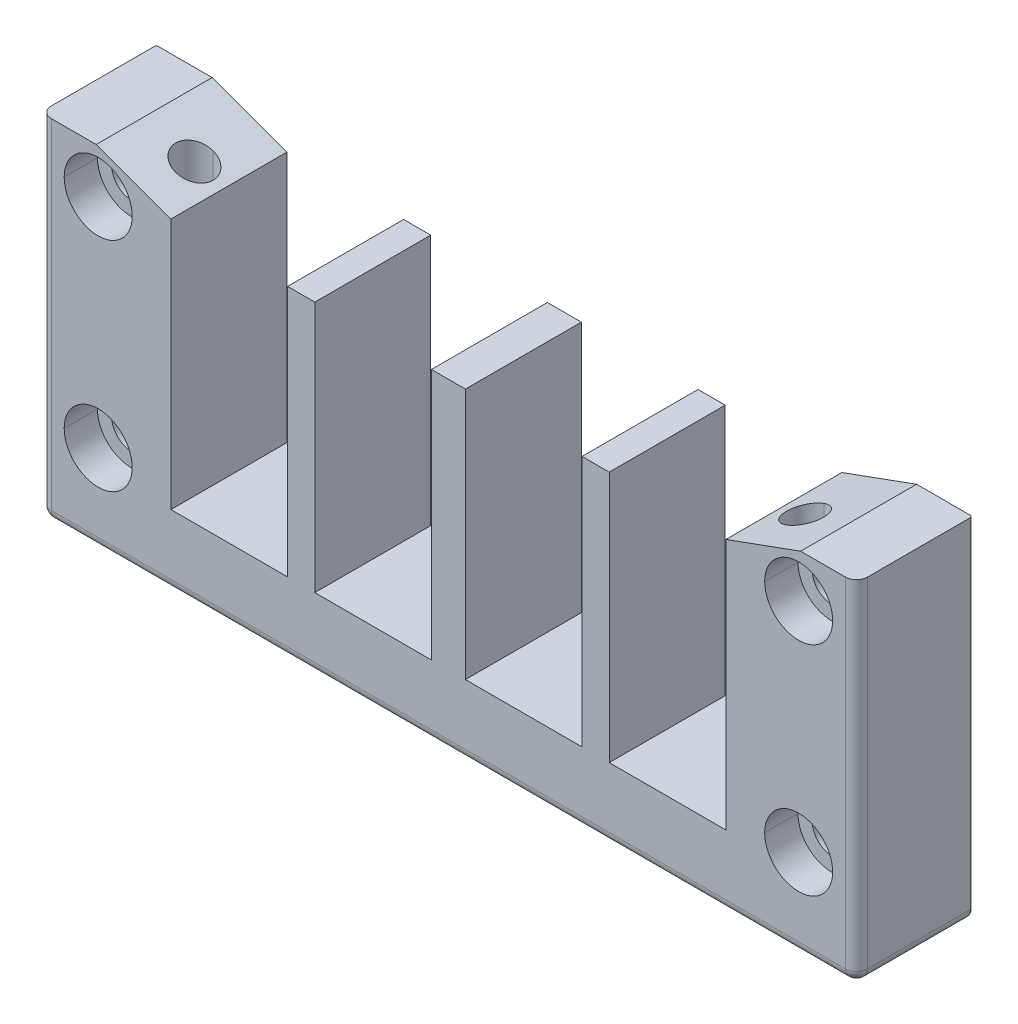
ISO-10303-21;
HEADER;
FILE_DESCRIPTION(('STEP AP214'),'2;1');
FILE_NAME('part.step','',(''),(''),'','','');
FILE_SCHEMA(('AUTOMOTIVE_DESIGN { 1 0 10303 214 1 1 1 1 }'));
ENDSEC;
DATA;
#1=APPLICATION_CONTEXT('core data for automotive mechanical design processes');
#2=APPLICATION_PROTOCOL_DEFINITION('international standard','automotive_design',2000,#1);
#3=PRODUCT_CONTEXT('',#1,'mechanical');
#4=PRODUCT('Part','Part','',(#3));
#5=PRODUCT_RELATED_PRODUCT_CATEGORY('part','',(#4));
#6=PRODUCT_DEFINITION_FORMATION('','',#4);
#7=PRODUCT_DEFINITION_CONTEXT('part definition',#1,'design');
#8=PRODUCT_DEFINITION('design','',#6,#7);
#9=PRODUCT_DEFINITION_SHAPE('','',#8);
#10=(LENGTH_UNIT() NAMED_UNIT(*) SI_UNIT(.MILLI.,.METRE.));
#11=(NAMED_UNIT(*) PLANE_ANGLE_UNIT() SI_UNIT($,.RADIAN.));
#12=(NAMED_UNIT(*) SI_UNIT($,.STERADIAN.) SOLID_ANGLE_UNIT());
#13=UNCERTAINTY_MEASURE_WITH_UNIT(LENGTH_MEASURE(1.E-05),#10,'distance_accuracy_value','');
#14=(GEOMETRIC_REPRESENTATION_CONTEXT(3) GLOBAL_UNCERTAINTY_ASSIGNED_CONTEXT((#13)) GLOBAL_UNIT_ASSIGNED_CONTEXT((#10,
#11,#12)) REPRESENTATION_CONTEXT('',''));
#15=CARTESIAN_POINT('',(0.,0.,0.));
#16=DIRECTION('',(0.,0.,1.));
#17=DIRECTION('',(1.,0.,0.));
#18=AXIS2_PLACEMENT_3D('',#15,#16,#17);
#19=CARTESIAN_POINT('',(47.2671361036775,-22.,-3.125));
#20=DIRECTION('',(0.866025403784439,0.,-0.5));
#21=DIRECTION('',(0.,-1.,0.));
#22=AXIS2_PLACEMENT_3D('',#19,#20,#21);
#23=PLANE('',#22);
#24=DIRECTION('',(0.5,0.,0.866025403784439));
#25=VECTOR('',#24,1.);
#26=CARTESIAN_POINT('',(47.2671361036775,-29.,-3.125));
#27=LINE('',#26,#25);
#28=CARTESIAN_POINT('',(47.2671361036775,-29.,-3.125));
#29=VERTEX_POINT('',#28);
#30=CARTESIAN_POINT('',(49.6342722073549,-29.,0.975));
#31=VERTEX_POINT('',#30);
#32=EDGE_CURVE('E749',#29,#31,#27,.T.);
#33=ORIENTED_EDGE('',*,*,#32,.T.);
#34=DIRECTION('',(0.,-1.,0.));
#35=VECTOR('',#34,1.);
#36=CARTESIAN_POINT('',(49.6342722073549,-22.,0.975));
#37=LINE('',#36,#35);
#38=CARTESIAN_POINT('',(49.6342722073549,-22.,0.975));
#39=VERTEX_POINT('',#38);
#40=EDGE_CURVE('E11',#39,#31,#37,.T.);
#41=ORIENTED_EDGE('',*,*,#40,.F.);
#42=DIRECTION('',(0.5,0.,0.866025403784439));
#43=VECTOR('',#42,1.);
#44=CARTESIAN_POINT('',(47.2671361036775,-22.,-3.125));
#45=LINE('',#44,#43);
#46=CARTESIAN_POINT('',(47.2671361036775,-22.,-3.125));
#47=VERTEX_POINT('',#46);
#48=EDGE_CURVE('E943',#47,#39,#45,.T.);
#49=ORIENTED_EDGE('',*,*,#48,.F.);
#50=DIRECTION('',(0.,-1.,0.));
#51=VECTOR('',#50,1.);
#52=CARTESIAN_POINT('',(47.2671361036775,-22.,-3.125));
#53=LINE('',#52,#51);
#54=EDGE_CURVE('E323',#47,#29,#53,.T.);
#55=ORIENTED_EDGE('',*,*,#54,.T.);
#56=EDGE_LOOP('',(#33,#41,#49,#55));
#57=FACE_BOUND('',#56,.T.);
#58=ADVANCED_FACE('F16',(#57),#23,.F.);
#59=CARTESIAN_POINT('',(49.6342722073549,-22.,0.975));
#60=DIRECTION('',(0.866025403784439,0.,0.5));
#61=DIRECTION('',(0.,-1.,0.));
#62=AXIS2_PLACEMENT_3D('',#59,#60,#61);
#63=PLANE('',#62);
#64=DIRECTION('',(-0.5,0.,0.86602540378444));
#65=VECTOR('',#64,1.);
#66=CARTESIAN_POINT('',(49.6342722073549,-29.,0.975));
#67=LINE('',#66,#65);
#68=CARTESIAN_POINT('',(47.2671361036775,-29.,5.075));
#69=VERTEX_POINT('',#68);
#70=EDGE_CURVE('E741',#31,#69,#67,.T.);
#71=ORIENTED_EDGE('',*,*,#70,.T.);
#72=DIRECTION('',(0.,-1.,0.));
#73=VECTOR('',#72,1.);
#74=CARTESIAN_POINT('',(47.2671361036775,-22.,5.075));
#75=LINE('',#74,#73);
#76=CARTESIAN_POINT('',(47.2671361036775,-22.,5.075));
#77=VERTEX_POINT('',#76);
#78=EDGE_CURVE('E25',#77,#69,#75,.T.);
#79=ORIENTED_EDGE('',*,*,#78,.F.);
#80=DIRECTION('',(-0.5,0.,0.86602540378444));
#81=VECTOR('',#80,1.);
#82=CARTESIAN_POINT('',(49.6342722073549,-22.,0.975));
#83=LINE('',#82,#81);
#84=EDGE_CURVE('E947',#39,#77,#83,.T.);
#85=ORIENTED_EDGE('',*,*,#84,.F.);
#86=ORIENTED_EDGE('',*,*,#40,.T.);
#87=EDGE_LOOP('',(#71,#79,#85,#86));
#88=FACE_BOUND('',#87,.T.);
#89=ADVANCED_FACE('F18',(#88),#63,.F.);
#90=CARTESIAN_POINT('',(47.2671361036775,-22.,5.075));
#91=DIRECTION('',(0.,0.,1.));
#92=DIRECTION('',(1.,0.,0.));
#93=AXIS2_PLACEMENT_3D('',#90,#91,#92);
#94=PLANE('',#93);
#95=DIRECTION('',(-1.,0.,0.));
#96=VECTOR('',#95,1.);
#97=CARTESIAN_POINT('',(47.2671361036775,-29.,5.075));
#98=LINE('',#97,#96);
#99=CARTESIAN_POINT('',(42.5328638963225,-29.,5.075));
#100=VERTEX_POINT('',#99);
#101=EDGE_CURVE('E689',#69,#100,#98,.T.);
#102=ORIENTED_EDGE('',*,*,#101,.T.);
#103=DIRECTION('',(0.,-1.,0.));
#104=VECTOR('',#103,1.);
#105=CARTESIAN_POINT('',(42.5328638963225,-22.,5.075));
#106=LINE('',#105,#104);
#107=CARTESIAN_POINT('',(42.5328638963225,-22.,5.075));
#108=VERTEX_POINT('',#107);
#109=EDGE_CURVE('E49',#108,#100,#106,.T.);
#110=ORIENTED_EDGE('',*,*,#109,.F.);
#111=DIRECTION('',(-1.,0.,0.));
#112=VECTOR('',#111,1.);
#113=CARTESIAN_POINT('',(47.2671361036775,-22.,5.075));
#114=LINE('',#113,#112);
#115=EDGE_CURVE('E951',#77,#108,#114,.T.);
#116=ORIENTED_EDGE('',*,*,#115,.F.);
#117=ORIENTED_EDGE('',*,*,#78,.T.);
#118=EDGE_LOOP('',(#102,#110,#116,#117));
#119=FACE_BOUND('',#118,.T.);
#120=ADVANCED_FACE('F1324',(#119),#94,.F.);
#121=CARTESIAN_POINT('',(42.5328638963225,-22.,5.075));
#122=DIRECTION('',(-0.866025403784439,0.,0.5));
#123=DIRECTION('',(0.,1.,0.));
#124=AXIS2_PLACEMENT_3D('',#121,#122,#123);
#125=PLANE('',#124);
#126=DIRECTION('',(-0.5,0.,-0.866025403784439));
#127=VECTOR('',#126,1.);
#128=CARTESIAN_POINT('',(42.5328638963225,-29.,5.075));
#129=LINE('',#128,#127);
#130=CARTESIAN_POINT('',(40.1657277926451,-29.,0.975));
#131=VERTEX_POINT('',#130);
#132=EDGE_CURVE('E686',#100,#131,#129,.T.);
#133=ORIENTED_EDGE('',*,*,#132,.T.);
#134=DIRECTION('',(0.,-1.,0.));
#135=VECTOR('',#134,1.);
#136=CARTESIAN_POINT('',(40.1657277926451,-22.,0.975));
#137=LINE('',#136,#135);
#138=CARTESIAN_POINT('',(40.1657277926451,-22.,0.975));
#139=VERTEX_POINT('',#138);
#140=EDGE_CURVE('E36',#139,#131,#137,.T.);
#141=ORIENTED_EDGE('',*,*,#140,.F.);
#142=DIRECTION('',(-0.5,0.,-0.866025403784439));
#143=VECTOR('',#142,1.);
#144=CARTESIAN_POINT('',(42.5328638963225,-22.,5.075));
#145=LINE('',#144,#143);
#146=EDGE_CURVE('E955',#108,#139,#145,.T.);
#147=ORIENTED_EDGE('',*,*,#146,.F.);
#148=ORIENTED_EDGE('',*,*,#109,.T.);
#149=EDGE_LOOP('',(#133,#141,#147,#148));
#150=FACE_BOUND('',#149,.T.);
#151=ADVANCED_FACE('F1493',(#150),#125,.F.);
#152=CARTESIAN_POINT('',(40.1657277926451,-22.,0.975));
#153=DIRECTION('',(-0.866025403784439,0.,-0.5));
#154=DIRECTION('',(-0.5,0.,0.866025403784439));
#155=AXIS2_PLACEMENT_3D('',#152,#153,#154);
#156=PLANE('',#155);
#157=DIRECTION('',(0.5,0.,-0.866025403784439));
#158=VECTOR('',#157,1.);
#159=CARTESIAN_POINT('',(40.1657277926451,-29.,0.975));
#160=LINE('',#159,#158);
#161=CARTESIAN_POINT('',(42.5328638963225,-29.,-3.125));
#162=VERTEX_POINT('',#161);
#163=EDGE_CURVE('E690',#131,#162,#160,.T.);
#164=ORIENTED_EDGE('',*,*,#163,.T.);
#165=DIRECTION('',(0.,-1.,0.));
#166=VECTOR('',#165,1.);
#167=CARTESIAN_POINT('',(42.5328638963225,-22.,-3.125));
#168=LINE('',#167,#166);
#169=CARTESIAN_POINT('',(42.5328638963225,-22.,-3.125));
#170=VERTEX_POINT('',#169);
#171=EDGE_CURVE('E963',#170,#162,#168,.T.);
#172=ORIENTED_EDGE('',*,*,#171,.F.);
#173=DIRECTION('',(0.5,0.,-0.866025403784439));
#174=VECTOR('',#173,1.);
#175=CARTESIAN_POINT('',(40.1657277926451,-22.,0.975));
#176=LINE('',#175,#174);
#177=EDGE_CURVE('E959',#139,#170,#176,.T.);
#178=ORIENTED_EDGE('',*,*,#177,.F.);
#179=ORIENTED_EDGE('',*,*,#140,.T.);
#180=EDGE_LOOP('',(#164,#172,#178,#179));
#181=FACE_BOUND('',#180,.T.);
#182=ADVANCED_FACE('F1490',(#181),#156,.F.);
#183=CARTESIAN_POINT('',(42.5328638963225,-22.,-3.125));
#184=DIRECTION('',(0.,0.,-1.));
#185=DIRECTION('',(-1.,0.,0.));
#186=AXIS2_PLACEMENT_3D('',#183,#184,#185);
#187=PLANE('',#186);
#188=DIRECTION('',(1.,0.,0.));
#189=VECTOR('',#188,1.);
#190=CARTESIAN_POINT('',(42.5328638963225,-29.,-3.125));
#191=LINE('',#190,#189);
#192=EDGE_CURVE('E746',#162,#29,#191,.T.);
#193=ORIENTED_EDGE('',*,*,#192,.T.);
#194=ORIENTED_EDGE('',*,*,#54,.F.);
#195=DIRECTION('',(1.,0.,0.));
#196=VECTOR('',#195,1.);
#197=CARTESIAN_POINT('',(42.5328638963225,-22.,-3.125));
#198=LINE('',#197,#196);
#199=EDGE_CURVE('E939',#170,#47,#198,.T.);
#200=ORIENTED_EDGE('',*,*,#199,.F.);
#201=ORIENTED_EDGE('',*,*,#171,.T.);
#202=EDGE_LOOP('',(#193,#194,#200,#201));
#203=FACE_BOUND('',#202,.T.);
#204=ADVANCED_FACE('F1459',(#203),#187,.F.);
#205=CARTESIAN_POINT('',(0.,-22.,0.));
#206=DIRECTION('',(0.,-1.,0.));
#207=DIRECTION('',(0.,0.,-1.));
#208=AXIS2_PLACEMENT_3D('',#205,#206,#207);
#209=PLANE('',#208);
#210=CARTESIAN_POINT('',(44.9,-22.,0.974999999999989));
#211=DIRECTION('',(0.,1.,0.));
#212=DIRECTION('',(0.,0.,-1.));
#213=AXIS2_PLACEMENT_3D('',#210,#211,#212);
#214=CIRCLE('',#213,2.75);
#215=CARTESIAN_POINT('',(44.9,-22.,3.725));
#216=VERTEX_POINT('',#215);
#217=CARTESIAN_POINT('',(44.9,-22.,-1.775));
#218=VERTEX_POINT('',#217);
#219=EDGE_CURVE('E521',#216,#218,#214,.T.);
#220=ORIENTED_EDGE('',*,*,#219,.T.);
#221=CARTESIAN_POINT('',(44.9,-22.,0.974999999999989));
#222=DIRECTION('',(0.,1.,0.));
#223=DIRECTION('',(0.,0.,-1.));
#224=AXIS2_PLACEMENT_3D('',#221,#222,#223);
#225=CIRCLE('',#224,2.75);
#226=EDGE_CURVE('E496',#218,#216,#225,.T.);
#227=ORIENTED_EDGE('',*,*,#226,.T.);
#228=EDGE_LOOP('',(#220,#227));
#229=FACE_BOUND('',#228,.T.);
#230=ORIENTED_EDGE('',*,*,#199,.T.);
#231=ORIENTED_EDGE('',*,*,#48,.T.);
#232=ORIENTED_EDGE('',*,*,#84,.T.);
#233=ORIENTED_EDGE('',*,*,#115,.T.);
#234=ORIENTED_EDGE('',*,*,#146,.T.);
#235=ORIENTED_EDGE('',*,*,#177,.T.);
#236=EDGE_LOOP('',(#230,#231,#232,#233,#234,#235));
#237=FACE_BOUND('',#236,.T.);
#238=ADVANCED_FACE('F1456',(#229,#237),#209,.T.);
#239=CARTESIAN_POINT('',(-42.5328638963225,-22.,-3.125));
#240=DIRECTION('',(0.866025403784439,0.,-0.5));
#241=DIRECTION('',(0.,-1.,0.));
#242=AXIS2_PLACEMENT_3D('',#239,#240,#241);
#243=PLANE('',#242);
#244=DIRECTION('',(0.5,0.,0.866025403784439));
#245=VECTOR('',#244,1.);
#246=CARTESIAN_POINT('',(-42.5328638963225,-29.,-3.125));
#247=LINE('',#246,#245);
#248=CARTESIAN_POINT('',(-42.5328638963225,-29.,-3.125));
#249=VERTEX_POINT('',#248);
#250=CARTESIAN_POINT('',(-40.1657277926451,-29.,0.975000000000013));
#251=VERTEX_POINT('',#250);
#252=EDGE_CURVE('E736',#249,#251,#247,.T.);
#253=ORIENTED_EDGE('',*,*,#252,.T.);
#254=DIRECTION('',(0.,-1.,0.));
#255=VECTOR('',#254,1.);
#256=CARTESIAN_POINT('',(-40.1657277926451,-22.,0.975000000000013));
#257=LINE('',#256,#255);
#258=CARTESIAN_POINT('',(-40.1657277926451,-22.,0.975000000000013));
#259=VERTEX_POINT('',#258);
#260=EDGE_CURVE('E935',#259,#251,#257,.T.);
#261=ORIENTED_EDGE('',*,*,#260,.F.);
#262=DIRECTION('',(0.5,0.,0.866025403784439));
#263=VECTOR('',#262,1.);
#264=CARTESIAN_POINT('',(-42.5328638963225,-22.,-3.125));
#265=LINE('',#264,#263);
#266=CARTESIAN_POINT('',(-42.5328638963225,-22.,-3.125));
#267=VERTEX_POINT('',#266);
#268=EDGE_CURVE('E899',#267,#259,#265,.T.);
#269=ORIENTED_EDGE('',*,*,#268,.F.);
#270=DIRECTION('',(0.,-1.,0.));
#271=VECTOR('',#270,1.);
#272=CARTESIAN_POINT('',(-42.5328638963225,-22.,-3.125));
#273=LINE('',#272,#271);
#274=EDGE_CURVE('E919',#267,#249,#273,.T.);
#275=ORIENTED_EDGE('',*,*,#274,.T.);
#276=EDGE_LOOP('',(#253,#261,#269,#275));
#277=FACE_BOUND('',#276,.T.);
#278=ADVANCED_FACE('F1361',(#277),#243,.F.);
#279=CARTESIAN_POINT('',(-40.1657277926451,-22.,0.975000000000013));
#280=DIRECTION('',(0.866025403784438,0.,0.5));
#281=DIRECTION('',(0.,-1.,0.));
#282=AXIS2_PLACEMENT_3D('',#279,#280,#281);
#283=PLANE('',#282);
#284=DIRECTION('',(-0.5,0.,0.866025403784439));
#285=VECTOR('',#284,1.);
#286=CARTESIAN_POINT('',(-40.1657277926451,-29.,0.975000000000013));
#287=LINE('',#286,#285);
#288=CARTESIAN_POINT('',(-42.5328638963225,-29.,5.075));
#289=VERTEX_POINT('',#288);
#290=EDGE_CURVE('E797',#251,#289,#287,.T.);
#291=ORIENTED_EDGE('',*,*,#290,.T.);
#292=DIRECTION('',(0.,-1.,0.));
#293=VECTOR('',#292,1.);
#294=CARTESIAN_POINT('',(-42.5328638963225,-22.,5.075));
#295=LINE('',#294,#293);
#296=CARTESIAN_POINT('',(-42.5328638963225,-22.,5.075));
#297=VERTEX_POINT('',#296);
#298=EDGE_CURVE('E932',#297,#289,#295,.T.);
#299=ORIENTED_EDGE('',*,*,#298,.F.);
#300=DIRECTION('',(-0.5,0.,0.866025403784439));
#301=VECTOR('',#300,1.);
#302=CARTESIAN_POINT('',(-40.1657277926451,-22.,0.975000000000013));
#303=LINE('',#302,#301);
#304=EDGE_CURVE('E903',#259,#297,#303,.T.);
#305=ORIENTED_EDGE('',*,*,#304,.F.);
#306=ORIENTED_EDGE('',*,*,#260,.T.);
#307=EDGE_LOOP('',(#291,#299,#305,#306));
#308=FACE_BOUND('',#307,.T.);
#309=ADVANCED_FACE('F1357',(#308),#283,.F.);
#310=CARTESIAN_POINT('',(-42.5328638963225,-22.,5.075));
#311=DIRECTION('',(0.,0.,1.));
#312=DIRECTION('',(1.,0.,0.));
#313=AXIS2_PLACEMENT_3D('',#310,#311,#312);
#314=PLANE('',#313);
#315=DIRECTION('',(-1.,0.,0.));
#316=VECTOR('',#315,1.);
#317=CARTESIAN_POINT('',(-42.5328638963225,-29.,5.075));
#318=LINE('',#317,#316);
#319=CARTESIAN_POINT('',(-47.2671361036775,-29.,5.075));
#320=VERTEX_POINT('',#319);
#321=EDGE_CURVE('E835',#289,#320,#318,.T.);
#322=ORIENTED_EDGE('',*,*,#321,.T.);
#323=DIRECTION('',(0.,-1.,0.));
#324=VECTOR('',#323,1.);
#325=CARTESIAN_POINT('',(-47.2671361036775,-22.,5.075));
#326=LINE('',#325,#324);
#327=CARTESIAN_POINT('',(-47.2671361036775,-22.,5.075));
#328=VERTEX_POINT('',#327);
#329=EDGE_CURVE('E929',#328,#320,#326,.T.);
#330=ORIENTED_EDGE('',*,*,#329,.F.);
#331=DIRECTION('',(-1.,0.,0.));
#332=VECTOR('',#331,1.);
#333=CARTESIAN_POINT('',(-42.5328638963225,-22.,5.075));
#334=LINE('',#333,#332);
#335=EDGE_CURVE('E907',#297,#328,#334,.T.);
#336=ORIENTED_EDGE('',*,*,#335,.F.);
#337=ORIENTED_EDGE('',*,*,#298,.T.);
#338=EDGE_LOOP('',(#322,#330,#336,#337));
#339=FACE_BOUND('',#338,.T.);
#340=ADVANCED_FACE('F1360',(#339),#314,.F.);
#341=CARTESIAN_POINT('',(-47.2671361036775,-22.,5.075));
#342=DIRECTION('',(-0.866025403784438,0.,0.5));
#343=DIRECTION('',(0.,1.,0.));
#344=AXIS2_PLACEMENT_3D('',#341,#342,#343);
#345=PLANE('',#344);
#346=DIRECTION('',(-0.5,0.,-0.866025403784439));
#347=VECTOR('',#346,1.);
#348=CARTESIAN_POINT('',(-47.2671361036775,-29.,5.075));
#349=LINE('',#348,#347);
#350=CARTESIAN_POINT('',(-49.6342722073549,-29.,0.975));
#351=VERTEX_POINT('',#350);
#352=EDGE_CURVE('E831',#320,#351,#349,.T.);
#353=ORIENTED_EDGE('',*,*,#352,.T.);
#354=DIRECTION('',(0.,-1.,0.));
#355=VECTOR('',#354,1.);
#356=CARTESIAN_POINT('',(-49.6342722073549,-22.,0.975));
#357=LINE('',#356,#355);
#358=CARTESIAN_POINT('',(-49.6342722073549,-22.,0.975));
#359=VERTEX_POINT('',#358);
#360=EDGE_CURVE('E925',#359,#351,#357,.T.);
#361=ORIENTED_EDGE('',*,*,#360,.F.);
#362=DIRECTION('',(-0.5,0.,-0.866025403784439));
#363=VECTOR('',#362,1.);
#364=CARTESIAN_POINT('',(-47.2671361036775,-22.,5.075));
#365=LINE('',#364,#363);
#366=EDGE_CURVE('E911',#328,#359,#365,.T.);
#367=ORIENTED_EDGE('',*,*,#366,.F.);
#368=ORIENTED_EDGE('',*,*,#329,.T.);
#369=EDGE_LOOP('',(#353,#361,#367,#368));
#370=FACE_BOUND('',#369,.T.);
#371=ADVANCED_FACE('F1516',(#370),#345,.F.);
#372=CARTESIAN_POINT('',(-49.6342722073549,-22.,0.975));
#373=DIRECTION('',(-0.866025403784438,0.,-0.5));
#374=DIRECTION('',(-0.5,0.,0.866025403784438));
#375=AXIS2_PLACEMENT_3D('',#372,#373,#374);
#376=PLANE('',#375);
#377=DIRECTION('',(0.5,0.,-0.866025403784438));
#378=VECTOR('',#377,1.);
#379=CARTESIAN_POINT('',(-49.6342722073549,-29.,0.975));
#380=LINE('',#379,#378);
#381=CARTESIAN_POINT('',(-47.2671361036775,-29.,-3.125));
#382=VERTEX_POINT('',#381);
#383=EDGE_CURVE('E827',#351,#382,#380,.T.);
#384=ORIENTED_EDGE('',*,*,#383,.T.);
#385=DIRECTION('',(0.,-1.,0.));
#386=VECTOR('',#385,1.);
#387=CARTESIAN_POINT('',(-47.2671361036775,-22.,-3.125));
#388=LINE('',#387,#386);
#389=CARTESIAN_POINT('',(-47.2671361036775,-22.,-3.125));
#390=VERTEX_POINT('',#389);
#391=EDGE_CURVE('E922',#390,#382,#388,.T.);
#392=ORIENTED_EDGE('',*,*,#391,.F.);
#393=DIRECTION('',(0.5,0.,-0.866025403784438));
#394=VECTOR('',#393,1.);
#395=CARTESIAN_POINT('',(-49.6342722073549,-22.,0.975));
#396=LINE('',#395,#394);
#397=EDGE_CURVE('E915',#359,#390,#396,.T.);
#398=ORIENTED_EDGE('',*,*,#397,.F.);
#399=ORIENTED_EDGE('',*,*,#360,.T.);
#400=EDGE_LOOP('',(#384,#392,#398,#399));
#401=FACE_BOUND('',#400,.T.);
#402=ADVANCED_FACE('F1519',(#401),#376,.F.);
#403=CARTESIAN_POINT('',(-47.2671361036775,-22.,-3.125));
#404=DIRECTION('',(0.,0.,-1.));
#405=DIRECTION('',(0.,-1.,0.));
#406=AXIS2_PLACEMENT_3D('',#403,#404,#405);
#407=PLANE('',#406);
#408=DIRECTION('',(1.,0.,0.));
#409=VECTOR('',#408,1.);
#410=CARTESIAN_POINT('',(-47.2671361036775,-29.,-3.125));
#411=LINE('',#410,#409);
#412=EDGE_CURVE('E740',#382,#249,#411,.T.);
#413=ORIENTED_EDGE('',*,*,#412,.T.);
#414=ORIENTED_EDGE('',*,*,#274,.F.);
#415=DIRECTION('',(1.,0.,0.));
#416=VECTOR('',#415,1.);
#417=CARTESIAN_POINT('',(-47.2671361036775,-22.,-3.125));
#418=LINE('',#417,#416);
#419=EDGE_CURVE('E898',#390,#267,#418,.T.);
#420=ORIENTED_EDGE('',*,*,#419,.F.);
#421=ORIENTED_EDGE('',*,*,#391,.T.);
#422=EDGE_LOOP('',(#413,#414,#420,#421));
#423=FACE_BOUND('',#422,.T.);
#424=ADVANCED_FACE('F1514',(#423),#407,.F.);
#425=CARTESIAN_POINT('',(0.,-22.,0.));
#426=DIRECTION('',(0.,-1.,0.));
#427=DIRECTION('',(0.,0.,-1.));
#428=AXIS2_PLACEMENT_3D('',#425,#426,#427);
#429=PLANE('',#428);
#430=CARTESIAN_POINT('',(-44.9,-22.,0.975));
#431=DIRECTION('',(0.,1.,0.));
#432=DIRECTION('',(0.,0.,-1.));
#433=AXIS2_PLACEMENT_3D('',#430,#431,#432);
#434=CIRCLE('',#433,2.75);
#435=CARTESIAN_POINT('',(-44.9,-22.,3.725));
#436=VERTEX_POINT('',#435);
#437=CARTESIAN_POINT('',(-44.9,-22.,-1.775));
#438=VERTEX_POINT('',#437);
#439=EDGE_CURVE('E529',#436,#438,#434,.T.);
#440=ORIENTED_EDGE('',*,*,#439,.T.);
#441=CARTESIAN_POINT('',(-44.9,-22.,0.975));
#442=DIRECTION('',(0.,1.,0.));
#443=DIRECTION('',(0.,0.,-1.));
#444=AXIS2_PLACEMENT_3D('',#441,#442,#443);
#445=CIRCLE('',#444,2.75);
#446=EDGE_CURVE('E475',#438,#436,#445,.T.);
#447=ORIENTED_EDGE('',*,*,#446,.T.);
#448=EDGE_LOOP('',(#440,#447));
#449=FACE_BOUND('',#448,.T.);
#450=ORIENTED_EDGE('',*,*,#419,.T.);
#451=ORIENTED_EDGE('',*,*,#268,.T.);
#452=ORIENTED_EDGE('',*,*,#304,.T.);
#453=ORIENTED_EDGE('',*,*,#335,.T.);
#454=ORIENTED_EDGE('',*,*,#366,.T.);
#455=ORIENTED_EDGE('',*,*,#397,.T.);
#456=EDGE_LOOP('',(#450,#451,#452,#453,#454,#455));
#457=FACE_BOUND('',#456,.T.);
#458=ADVANCED_FACE('F1511',(#449,#457),#429,.T.);
#459=CARTESIAN_POINT('',(-51.5,16.,8.525));
#460=DIRECTION('',(0.,0.,1.));
#461=DIRECTION('',(1.,0.,0.));
#462=AXIS2_PLACEMENT_3D('',#459,#460,#461);
#463=CYLINDRICAL_SURFACE('',#462,5.);
#464=DIRECTION('',(0.,0.,1.));
#465=VECTOR('',#464,1.);
#466=CARTESIAN_POINT('',(-56.5,16.,8.525));
#467=LINE('',#466,#465);
#468=CARTESIAN_POINT('',(-56.5,16.,3.625));
#469=VERTEX_POINT('',#468);
#470=CARTESIAN_POINT('',(-56.5,16.,8.525));
#471=VERTEX_POINT('',#470);
#472=EDGE_CURVE('E1413',#469,#471,#467,.T.);
#473=ORIENTED_EDGE('',*,*,#472,.F.);
#474=CARTESIAN_POINT('',(-51.5,16.,3.625));
#475=DIRECTION('',(0.,0.,1.));
#476=DIRECTION('',(1.,0.,0.));
#477=AXIS2_PLACEMENT_3D('',#474,#475,#476);
#478=CIRCLE('',#477,5.);
#479=CARTESIAN_POINT('',(-46.5,16.,3.625));
#480=VERTEX_POINT('',#479);
#481=EDGE_CURVE('E894',#480,#469,#478,.T.);
#482=ORIENTED_EDGE('',*,*,#481,.F.);
#483=DIRECTION('',(0.,0.,1.));
#484=VECTOR('',#483,1.);
#485=CARTESIAN_POINT('',(-46.5,16.,8.525));
#486=LINE('',#485,#484);
#487=CARTESIAN_POINT('',(-46.5,16.,8.525));
#488=VERTEX_POINT('',#487);
#489=EDGE_CURVE('E1007',#480,#488,#486,.T.);
#490=ORIENTED_EDGE('',*,*,#489,.T.);
#491=CARTESIAN_POINT('',(-51.5,16.,8.525));
#492=DIRECTION('',(0.,0.,1.));
#493=DIRECTION('',(1.,0.,0.));
#494=AXIS2_PLACEMENT_3D('',#491,#492,#493);
#495=CIRCLE('',#494,5.);
#496=EDGE_CURVE('E632',#488,#471,#495,.T.);
#497=ORIENTED_EDGE('',*,*,#496,.T.);
#498=EDGE_LOOP('',(#473,#482,#490,#497));
#499=FACE_BOUND('',#498,.T.);
#500=ADVANCED_FACE('F1410',(#499),#463,.F.);
#501=CARTESIAN_POINT('',(-48.6,16.,3.625));
#502=DIRECTION('',(0.,0.,-1.));
#503=DIRECTION('',(0.,-1.,0.));
#504=AXIS2_PLACEMENT_3D('',#501,#502,#503);
#505=PLANE('',#504);
#506=CARTESIAN_POINT('',(-51.5,16.,3.625));
#507=DIRECTION('',(0.,0.,1.));
#508=DIRECTION('',(1.,0.,0.));
#509=AXIS2_PLACEMENT_3D('',#506,#507,#508);
#510=CIRCLE('',#509,2.9);
#511=CARTESIAN_POINT('',(-48.6,16.,3.625));
#512=VERTEX_POINT('',#511);
#513=CARTESIAN_POINT('',(-54.4,16.,3.625));
#514=VERTEX_POINT('',#513);
#515=EDGE_CURVE('E890',#512,#514,#510,.T.);
#516=ORIENTED_EDGE('',*,*,#515,.F.);
#517=CARTESIAN_POINT('',(-51.5,16.,3.625));
#518=DIRECTION('',(0.,0.,1.));
#519=DIRECTION('',(1.,0.,0.));
#520=AXIS2_PLACEMENT_3D('',#517,#518,#519);
#521=CIRCLE('',#520,2.9);
#522=EDGE_CURVE('E1027',#514,#512,#521,.T.);
#523=ORIENTED_EDGE('',*,*,#522,.F.);
#524=EDGE_LOOP('',(#516,#523));
#525=FACE_BOUND('',#524,.T.);
#526=ORIENTED_EDGE('',*,*,#481,.T.);
#527=CARTESIAN_POINT('',(-51.5,16.,3.625));
#528=DIRECTION('',(0.,0.,1.));
#529=DIRECTION('',(1.,0.,0.));
#530=AXIS2_PLACEMENT_3D('',#527,#528,#529);
#531=CIRCLE('',#530,5.);
#532=EDGE_CURVE('E1420',#469,#480,#531,.T.);
#533=ORIENTED_EDGE('',*,*,#532,.T.);
#534=EDGE_LOOP('',(#526,#533));
#535=FACE_BOUND('',#534,.T.);
#536=ADVANCED_FACE('F1504',(#525,#535),#505,.F.);
#537=CARTESIAN_POINT('',(-51.5,16.,8.525));
#538=DIRECTION('',(0.,0.,1.));
#539=DIRECTION('',(1.,0.,0.));
#540=AXIS2_PLACEMENT_3D('',#537,#538,#539);
#541=CYLINDRICAL_SURFACE('',#540,2.9);
#542=DIRECTION('',(0.,0.,1.));
#543=VECTOR('',#542,1.);
#544=CARTESIAN_POINT('',(-54.4,16.,8.525));
#545=LINE('',#544,#543);
#546=CARTESIAN_POINT('',(-54.4,16.,-8.525));
#547=VERTEX_POINT('',#546);
#548=EDGE_CURVE('E1019',#547,#514,#545,.T.);
#549=ORIENTED_EDGE('',*,*,#548,.F.);
#550=CARTESIAN_POINT('',(-51.5,16.,-8.525));
#551=DIRECTION('',(0.,0.,1.));
#552=DIRECTION('',(1.,0.,0.));
#553=AXIS2_PLACEMENT_3D('',#550,#551,#552);
#554=CIRCLE('',#553,2.9);
#555=CARTESIAN_POINT('',(-48.6,16.,-8.525));
#556=VERTEX_POINT('',#555);
#557=EDGE_CURVE('E753',#556,#547,#554,.T.);
#558=ORIENTED_EDGE('',*,*,#557,.F.);
#559=DIRECTION('',(0.,0.,1.));
#560=VECTOR('',#559,1.);
#561=CARTESIAN_POINT('',(-48.6,16.,8.525));
#562=LINE('',#561,#560);
#563=EDGE_CURVE('E1034',#556,#512,#562,.T.);
#564=ORIENTED_EDGE('',*,*,#563,.T.);
#565=ORIENTED_EDGE('',*,*,#515,.T.);
#566=EDGE_LOOP('',(#549,#558,#564,#565));
#567=FACE_BOUND('',#566,.T.);
#568=ADVANCED_FACE('F1500',(#567),#541,.F.);
#569=CARTESIAN_POINT('',(-51.5,-16.,8.525));
#570=DIRECTION('',(0.,0.,1.));
#571=DIRECTION('',(1.,0.,0.));
#572=AXIS2_PLACEMENT_3D('',#569,#570,#571);
#573=CYLINDRICAL_SURFACE('',#572,5.);
#574=DIRECTION('',(0.,0.,1.));
#575=VECTOR('',#574,1.);
#576=CARTESIAN_POINT('',(-56.5,-16.,8.525));
#577=LINE('',#576,#575);
#578=CARTESIAN_POINT('',(-56.5,-16.,3.625));
#579=VERTEX_POINT('',#578);
#580=CARTESIAN_POINT('',(-56.5,-16.,8.525));
#581=VERTEX_POINT('',#580);
#582=EDGE_CURVE('E1058',#579,#581,#577,.T.);
#583=ORIENTED_EDGE('',*,*,#582,.F.);
#584=CARTESIAN_POINT('',(-51.5,-16.,3.625));
#585=DIRECTION('',(0.,0.,1.));
#586=DIRECTION('',(1.,0.,0.));
#587=AXIS2_PLACEMENT_3D('',#584,#585,#586);
#588=CIRCLE('',#587,5.);
#589=CARTESIAN_POINT('',(-46.5,-16.,3.625));
#590=VERTEX_POINT('',#589);
#591=EDGE_CURVE('E886',#590,#579,#588,.T.);
#592=ORIENTED_EDGE('',*,*,#591,.F.);
#593=DIRECTION('',(0.,0.,1.));
#594=VECTOR('',#593,1.);
#595=CARTESIAN_POINT('',(-46.5,-16.,8.525));
#596=LINE('',#595,#594);
#597=CARTESIAN_POINT('',(-46.5,-16.,8.525));
#598=VERTEX_POINT('',#597);
#599=EDGE_CURVE('E1062',#590,#598,#596,.T.);
#600=ORIENTED_EDGE('',*,*,#599,.T.);
#601=CARTESIAN_POINT('',(-51.5,-16.,8.525));
#602=DIRECTION('',(0.,0.,1.));
#603=DIRECTION('',(1.,0.,0.));
#604=AXIS2_PLACEMENT_3D('',#601,#602,#603);
#605=CIRCLE('',#604,5.);
#606=EDGE_CURVE('E1020',#598,#581,#605,.T.);
#607=ORIENTED_EDGE('',*,*,#606,.T.);
#608=EDGE_LOOP('',(#583,#592,#600,#607));
#609=FACE_BOUND('',#608,.T.);
#610=ADVANCED_FACE('F1496',(#609),#573,.F.);
#611=CARTESIAN_POINT('',(-48.6,-16.,3.625));
#612=DIRECTION('',(0.,0.,-1.));
#613=DIRECTION('',(0.,-1.,0.));
#614=AXIS2_PLACEMENT_3D('',#611,#612,#613);
#615=PLANE('',#614);
#616=CARTESIAN_POINT('',(-51.5,-16.,3.625));
#617=DIRECTION('',(0.,0.,1.));
#618=DIRECTION('',(1.,0.,0.));
#619=AXIS2_PLACEMENT_3D('',#616,#617,#618);
#620=CIRCLE('',#619,2.9);
#621=CARTESIAN_POINT('',(-48.6,-16.,3.625));
#622=VERTEX_POINT('',#621);
#623=CARTESIAN_POINT('',(-54.4,-16.,3.625));
#624=VERTEX_POINT('',#623);
#625=EDGE_CURVE('E882',#622,#624,#620,.T.);
#626=ORIENTED_EDGE('',*,*,#625,.F.);
#627=CARTESIAN_POINT('',(-51.5,-16.,3.625));
#628=DIRECTION('',(0.,0.,1.));
#629=DIRECTION('',(1.,0.,0.));
#630=AXIS2_PLACEMENT_3D('',#627,#628,#629);
#631=CIRCLE('',#630,2.9);
#632=EDGE_CURVE('E1046',#624,#622,#631,.T.);
#633=ORIENTED_EDGE('',*,*,#632,.F.);
#634=EDGE_LOOP('',(#626,#633));
#635=FACE_BOUND('',#634,.T.);
#636=ORIENTED_EDGE('',*,*,#591,.T.);
#637=CARTESIAN_POINT('',(-51.5,-16.,3.625));
#638=DIRECTION('',(0.,0.,1.));
#639=DIRECTION('',(1.,0.,0.));
#640=AXIS2_PLACEMENT_3D('',#637,#638,#639);
#641=CIRCLE('',#640,5.);
#642=EDGE_CURVE('E1038',#579,#590,#641,.T.);
#643=ORIENTED_EDGE('',*,*,#642,.T.);
#644=EDGE_LOOP('',(#636,#643));
#645=FACE_BOUND('',#644,.T.);
#646=ADVANCED_FACE('F1488',(#635,#645),#615,.F.);
#647=CARTESIAN_POINT('',(-51.5,-16.,8.525));
#648=DIRECTION('',(0.,0.,1.));
#649=DIRECTION('',(1.,0.,0.));
#650=AXIS2_PLACEMENT_3D('',#647,#648,#649);
#651=CYLINDRICAL_SURFACE('',#650,2.9);
#652=DIRECTION('',(0.,0.,1.));
#653=VECTOR('',#652,1.);
#654=CARTESIAN_POINT('',(-54.4,-16.,8.525));
#655=LINE('',#654,#653);
#656=CARTESIAN_POINT('',(-54.4,-16.,-8.525));
#657=VERTEX_POINT('',#656);
#658=EDGE_CURVE('E1054',#657,#624,#655,.T.);
#659=ORIENTED_EDGE('',*,*,#658,.F.);
#660=CARTESIAN_POINT('',(-51.5,-16.,-8.525));
#661=DIRECTION('',(0.,0.,1.));
#662=DIRECTION('',(1.,0.,0.));
#663=AXIS2_PLACEMENT_3D('',#660,#661,#662);
#664=CIRCLE('',#663,2.9);
#665=CARTESIAN_POINT('',(-48.6,-16.,-8.525));
#666=VERTEX_POINT('',#665);
#667=EDGE_CURVE('E757',#666,#657,#664,.T.);
#668=ORIENTED_EDGE('',*,*,#667,.F.);
#669=DIRECTION('',(0.,0.,1.));
#670=VECTOR('',#669,1.);
#671=CARTESIAN_POINT('',(-48.6,-16.,8.525));
#672=LINE('',#671,#670);
#673=EDGE_CURVE('E1053',#666,#622,#672,.T.);
#674=ORIENTED_EDGE('',*,*,#673,.T.);
#675=ORIENTED_EDGE('',*,*,#625,.T.);
#676=EDGE_LOOP('',(#659,#668,#674,#675));
#677=FACE_BOUND('',#676,.T.);
#678=ADVANCED_FACE('F1386',(#677),#651,.F.);
#679=CARTESIAN_POINT('',(51.5,-16.,8.525));
#680=DIRECTION('',(0.,0.,1.));
#681=DIRECTION('',(1.,0.,0.));
#682=AXIS2_PLACEMENT_3D('',#679,#680,#681);
#683=CYLINDRICAL_SURFACE('',#682,5.);
#684=DIRECTION('',(0.,0.,1.));
#685=VECTOR('',#684,1.);
#686=CARTESIAN_POINT('',(46.5,-16.,8.525));
#687=LINE('',#686,#685);
#688=CARTESIAN_POINT('',(46.5,-16.,3.625));
#689=VERTEX_POINT('',#688);
#690=CARTESIAN_POINT('',(46.5,-16.,8.525));
#691=VERTEX_POINT('',#690);
#692=EDGE_CURVE('E1077',#689,#691,#687,.T.);
#693=ORIENTED_EDGE('',*,*,#692,.F.);
#694=CARTESIAN_POINT('',(51.5,-16.,3.625));
#695=DIRECTION('',(0.,0.,1.));
#696=DIRECTION('',(1.,0.,0.));
#697=AXIS2_PLACEMENT_3D('',#694,#695,#696);
#698=CIRCLE('',#697,5.);
#699=CARTESIAN_POINT('',(56.5,-16.,3.625));
#700=VERTEX_POINT('',#699);
#701=EDGE_CURVE('E878',#700,#689,#698,.T.);
#702=ORIENTED_EDGE('',*,*,#701,.F.);
#703=DIRECTION('',(0.,0.,1.));
#704=VECTOR('',#703,1.);
#705=CARTESIAN_POINT('',(56.5,-16.,8.525));
#706=LINE('',#705,#704);
#707=CARTESIAN_POINT('',(56.5,-16.,8.525));
#708=VERTEX_POINT('',#707);
#709=EDGE_CURVE('E1092',#700,#708,#706,.T.);
#710=ORIENTED_EDGE('',*,*,#709,.T.);
#711=CARTESIAN_POINT('',(51.5,-16.,8.525));
#712=DIRECTION('',(0.,0.,1.));
#713=DIRECTION('',(1.,0.,0.));
#714=AXIS2_PLACEMENT_3D('',#711,#712,#713);
#715=CIRCLE('',#714,5.);
#716=EDGE_CURVE('E637',#708,#691,#715,.T.);
#717=ORIENTED_EDGE('',*,*,#716,.T.);
#718=EDGE_LOOP('',(#693,#702,#710,#717));
#719=FACE_BOUND('',#718,.T.);
#720=ADVANCED_FACE('F1377',(#719),#683,.F.);
#721=CARTESIAN_POINT('',(54.4,-16.,3.625));
#722=DIRECTION('',(0.,0.,-1.));
#723=DIRECTION('',(0.,-1.,0.));
#724=AXIS2_PLACEMENT_3D('',#721,#722,#723);
#725=PLANE('',#724);
#726=CARTESIAN_POINT('',(51.5,-16.,3.625));
#727=DIRECTION('',(0.,0.,1.));
#728=DIRECTION('',(1.,0.,0.));
#729=AXIS2_PLACEMENT_3D('',#726,#727,#728);
#730=CIRCLE('',#729,2.9);
#731=CARTESIAN_POINT('',(54.4,-16.,3.625));
#732=VERTEX_POINT('',#731);
#733=CARTESIAN_POINT('',(48.6,-16.,3.625));
#734=VERTEX_POINT('',#733);
#735=EDGE_CURVE('E875',#732,#734,#730,.T.);
#736=ORIENTED_EDGE('',*,*,#735,.F.);
#737=CARTESIAN_POINT('',(51.5,-16.,3.625));
#738=DIRECTION('',(0.,0.,1.));
#739=DIRECTION('',(1.,0.,0.));
#740=AXIS2_PLACEMENT_3D('',#737,#738,#739);
#741=CIRCLE('',#740,2.9);
#742=EDGE_CURVE('E1107',#734,#732,#741,.T.);
#743=ORIENTED_EDGE('',*,*,#742,.F.);
#744=EDGE_LOOP('',(#736,#743));
#745=FACE_BOUND('',#744,.T.);
#746=ORIENTED_EDGE('',*,*,#701,.T.);
#747=CARTESIAN_POINT('',(51.5,-16.,3.625));
#748=DIRECTION('',(0.,0.,1.));
#749=DIRECTION('',(1.,0.,0.));
#750=AXIS2_PLACEMENT_3D('',#747,#748,#749);
#751=CIRCLE('',#750,5.);
#752=EDGE_CURVE('E1070',#689,#700,#751,.T.);
#753=ORIENTED_EDGE('',*,*,#752,.T.);
#754=EDGE_LOOP('',(#746,#753));
#755=FACE_BOUND('',#754,.T.);
#756=ADVANCED_FACE('F1374',(#745,#755),#725,.F.);
#757=CARTESIAN_POINT('',(51.5,-16.,8.525));
#758=DIRECTION('',(0.,0.,1.));
#759=DIRECTION('',(1.,0.,0.));
#760=AXIS2_PLACEMENT_3D('',#757,#758,#759);
#761=CYLINDRICAL_SURFACE('',#760,2.9);
#762=DIRECTION('',(0.,0.,1.));
#763=VECTOR('',#762,1.);
#764=CARTESIAN_POINT('',(48.6,-16.,8.525));
#765=LINE('',#764,#763);
#766=CARTESIAN_POINT('',(48.6,-16.,-8.525));
#767=VERTEX_POINT('',#766);
#768=EDGE_CURVE('E1103',#767,#734,#765,.T.);
#769=ORIENTED_EDGE('',*,*,#768,.F.);
#770=CARTESIAN_POINT('',(51.5,-16.,-8.525));
#771=DIRECTION('',(0.,0.,1.));
#772=DIRECTION('',(1.,0.,0.));
#773=AXIS2_PLACEMENT_3D('',#770,#771,#772);
#774=CIRCLE('',#773,2.9);
#775=CARTESIAN_POINT('',(54.4,-16.,-8.525));
#776=VERTEX_POINT('',#775);
#777=EDGE_CURVE('E761',#776,#767,#774,.T.);
#778=ORIENTED_EDGE('',*,*,#777,.F.);
#779=DIRECTION('',(0.,0.,1.));
#780=VECTOR('',#779,1.);
#781=CARTESIAN_POINT('',(54.4,-16.,8.525));
#782=LINE('',#781,#780);
#783=EDGE_CURVE('E1114',#776,#732,#782,.T.);
#784=ORIENTED_EDGE('',*,*,#783,.T.);
#785=ORIENTED_EDGE('',*,*,#735,.T.);
#786=EDGE_LOOP('',(#769,#778,#784,#785));
#787=FACE_BOUND('',#786,.T.);
#788=ADVANCED_FACE('F1376',(#787),#761,.F.);
#789=CARTESIAN_POINT('',(51.5,16.,8.525));
#790=DIRECTION('',(0.,0.,1.));
#791=DIRECTION('',(1.,0.,0.));
#792=AXIS2_PLACEMENT_3D('',#789,#790,#791);
#793=CYLINDRICAL_SURFACE('',#792,5.);
#794=DIRECTION('',(0.,0.,1.));
#795=VECTOR('',#794,1.);
#796=CARTESIAN_POINT('',(46.5,16.,8.525));
#797=LINE('',#796,#795);
#798=CARTESIAN_POINT('',(46.5,16.,3.625));
#799=VERTEX_POINT('',#798);
#800=CARTESIAN_POINT('',(46.5,16.,8.525));
#801=VERTEX_POINT('',#800);
#802=EDGE_CURVE('E1122',#799,#801,#797,.T.);
#803=ORIENTED_EDGE('',*,*,#802,.F.);
#804=CARTESIAN_POINT('',(51.5,16.,3.625));
#805=DIRECTION('',(0.,0.,1.));
#806=DIRECTION('',(1.,0.,0.));
#807=AXIS2_PLACEMENT_3D('',#804,#805,#806);
#808=CIRCLE('',#807,5.);
#809=CARTESIAN_POINT('',(56.5,16.,3.625));
#810=VERTEX_POINT('',#809);
#811=EDGE_CURVE('E872',#810,#799,#808,.T.);
#812=ORIENTED_EDGE('',*,*,#811,.F.);
#813=DIRECTION('',(0.,0.,1.));
#814=VECTOR('',#813,1.);
#815=CARTESIAN_POINT('',(56.5,16.,8.525));
#816=LINE('',#815,#814);
#817=CARTESIAN_POINT('',(56.5,16.,8.525));
#818=VERTEX_POINT('',#817);
#819=EDGE_CURVE('E996',#810,#818,#816,.T.);
#820=ORIENTED_EDGE('',*,*,#819,.T.);
#821=CARTESIAN_POINT('',(51.5,16.,8.525));
#822=DIRECTION('',(0.,0.,1.));
#823=DIRECTION('',(1.,0.,0.));
#824=AXIS2_PLACEMENT_3D('',#821,#822,#823);
#825=CIRCLE('',#824,5.);
#826=EDGE_CURVE('E633',#818,#801,#825,.T.);
#827=ORIENTED_EDGE('',*,*,#826,.T.);
#828=EDGE_LOOP('',(#803,#812,#820,#827));
#829=FACE_BOUND('',#828,.T.);
#830=ADVANCED_FACE('F1383',(#829),#793,.F.);
#831=CARTESIAN_POINT('',(54.4,16.,3.625));
#832=DIRECTION('',(0.,0.,-1.));
#833=DIRECTION('',(0.,-1.,0.));
#834=AXIS2_PLACEMENT_3D('',#831,#832,#833);
#835=PLANE('',#834);
#836=CARTESIAN_POINT('',(51.5,16.,3.625));
#837=DIRECTION('',(0.,0.,1.));
#838=DIRECTION('',(1.,0.,0.));
#839=AXIS2_PLACEMENT_3D('',#836,#837,#838);
#840=CIRCLE('',#839,2.9);
#841=CARTESIAN_POINT('',(54.4,16.,3.625));
#842=VERTEX_POINT('',#841);
#843=CARTESIAN_POINT('',(48.6,16.,3.625));
#844=VERTEX_POINT('',#843);
#845=EDGE_CURVE('E869',#842,#844,#840,.T.);
#846=ORIENTED_EDGE('',*,*,#845,.F.);
#847=CARTESIAN_POINT('',(51.5,16.,3.625));
#848=DIRECTION('',(0.,0.,1.));
#849=DIRECTION('',(1.,0.,0.));
#850=AXIS2_PLACEMENT_3D('',#847,#848,#849);
#851=CIRCLE('',#850,2.9);
#852=EDGE_CURVE('E978',#844,#842,#851,.T.);
#853=ORIENTED_EDGE('',*,*,#852,.F.);
#854=EDGE_LOOP('',(#846,#853));
#855=FACE_BOUND('',#854,.T.);
#856=ORIENTED_EDGE('',*,*,#811,.T.);
#857=CARTESIAN_POINT('',(51.5,16.,3.625));
#858=DIRECTION('',(0.,0.,1.));
#859=DIRECTION('',(1.,0.,0.));
#860=AXIS2_PLACEMENT_3D('',#857,#858,#859);
#861=CIRCLE('',#860,5.);
#862=EDGE_CURVE('E1118',#799,#810,#861,.T.);
#863=ORIENTED_EDGE('',*,*,#862,.T.);
#864=EDGE_LOOP('',(#856,#863));
#865=FACE_BOUND('',#864,.T.);
#866=ADVANCED_FACE('F1479',(#855,#865),#835,.F.);
#867=CARTESIAN_POINT('',(51.5,16.,8.525));
#868=DIRECTION('',(0.,0.,1.));
#869=DIRECTION('',(1.,0.,0.));
#870=AXIS2_PLACEMENT_3D('',#867,#868,#869);
#871=CYLINDRICAL_SURFACE('',#870,2.9);
#872=DIRECTION('',(0.,0.,1.));
#873=VECTOR('',#872,1.);
#874=CARTESIAN_POINT('',(48.6,16.,8.525));
#875=LINE('',#874,#873);
#876=CARTESIAN_POINT('',(48.6,16.,-8.525));
#877=VERTEX_POINT('',#876);
#878=EDGE_CURVE('E976',#877,#844,#875,.T.);
#879=ORIENTED_EDGE('',*,*,#878,.F.);
#880=CARTESIAN_POINT('',(51.5,16.,-8.525));
#881=DIRECTION('',(0.,0.,1.));
#882=DIRECTION('',(1.,0.,0.));
#883=AXIS2_PLACEMENT_3D('',#880,#881,#882);
#884=CIRCLE('',#883,2.9);
#885=CARTESIAN_POINT('',(54.4,16.,-8.525));
#886=VERTEX_POINT('',#885);
#887=EDGE_CURVE('E764',#886,#877,#884,.T.);
#888=ORIENTED_EDGE('',*,*,#887,.F.);
#889=DIRECTION('',(0.,0.,1.));
#890=VECTOR('',#889,1.);
#891=CARTESIAN_POINT('',(54.4,16.,8.525));
#892=LINE('',#891,#890);
#893=EDGE_CURVE('E980',#886,#842,#892,.T.);
#894=ORIENTED_EDGE('',*,*,#893,.T.);
#895=ORIENTED_EDGE('',*,*,#845,.T.);
#896=EDGE_LOOP('',(#879,#888,#894,#895));
#897=FACE_BOUND('',#896,.T.);
#898=ADVANCED_FACE('F1302',(#897),#871,.F.);
#899=CARTESIAN_POINT('',(-40.8,18.495,-128.591982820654));
#900=DIRECTION('',(0.,1.,0.));
#901=DIRECTION('',(1.,0.,0.));
#902=AXIS2_PLACEMENT_3D('',#899,#900,#901);
#903=PLANE('',#902);
#904=DIRECTION('',(-1.,0.,0.));
#905=VECTOR('',#904,1.);
#906=CARTESIAN_POINT('',(-40.8,18.495,8.525));
#907=LINE('',#906,#905);
#908=CARTESIAN_POINT('',(-19.65,18.495,8.525));
#909=VERTEX_POINT('',#908);
#910=CARTESIAN_POINT('',(-23.65,18.495,8.525));
#911=VERTEX_POINT('',#910);
#912=EDGE_CURVE('E471',#909,#911,#907,.T.);
#913=ORIENTED_EDGE('',*,*,#912,.F.);
#914=DIRECTION('',(0.,0.,1.));
#915=VECTOR('',#914,1.);
#916=CARTESIAN_POINT('',(-19.65,18.495,-45.8613094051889));
#917=LINE('',#916,#915);
#918=CARTESIAN_POINT('',(-19.65,18.495,-8.525));
#919=VERTEX_POINT('',#918);
#920=EDGE_CURVE('E657',#919,#909,#917,.T.);
#921=ORIENTED_EDGE('',*,*,#920,.F.);
#922=DIRECTION('',(1.,0.,0.));
#923=VECTOR('',#922,1.);
#924=CARTESIAN_POINT('',(-40.8,18.495,-8.525));
#925=LINE('',#924,#923);
#926=CARTESIAN_POINT('',(-23.65,18.495,-8.525));
#927=VERTEX_POINT('',#926);
#928=EDGE_CURVE('E714',#927,#919,#925,.T.);
#929=ORIENTED_EDGE('',*,*,#928,.F.);
#930=DIRECTION('',(0.,0.,-1.));
#931=VECTOR('',#930,1.);
#932=CARTESIAN_POINT('',(-23.65,18.495,-45.8613094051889));
#933=LINE('',#932,#931);
#934=EDGE_CURVE('E645',#911,#927,#933,.T.);
#935=ORIENTED_EDGE('',*,*,#934,.F.);
#936=EDGE_LOOP('',(#913,#921,#929,#935));
#937=FACE_BOUND('',#936,.T.);
#938=ADVANCED_FACE('F1172',(#937),#903,.T.);
#939=CARTESIAN_POINT('',(-40.8,18.495,-128.591982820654));
#940=DIRECTION('',(0.,1.,0.));
#941=DIRECTION('',(1.,0.,0.));
#942=AXIS2_PLACEMENT_3D('',#939,#940,#941);
#943=PLANE('',#942);
#944=DIRECTION('',(-1.,0.,0.));
#945=VECTOR('',#944,1.);
#946=CARTESIAN_POINT('',(-40.8,18.495,8.525));
#947=LINE('',#946,#945);
#948=CARTESIAN_POINT('',(2.5,18.495,8.525));
#949=VERTEX_POINT('',#948);
#950=CARTESIAN_POINT('',(-2.5,18.495,8.525));
#951=VERTEX_POINT('',#950);
#952=EDGE_CURVE('E571',#949,#951,#947,.T.);
#953=ORIENTED_EDGE('',*,*,#952,.F.);
#954=DIRECTION('',(0.,0.,1.));
#955=VECTOR('',#954,1.);
#956=CARTESIAN_POINT('',(2.5,18.495,-45.8613094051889));
#957=LINE('',#956,#955);
#958=CARTESIAN_POINT('',(2.5,18.495,-8.525));
#959=VERTEX_POINT('',#958);
#960=EDGE_CURVE('E606',#959,#949,#957,.T.);
#961=ORIENTED_EDGE('',*,*,#960,.F.);
#962=DIRECTION('',(1.,0.,0.));
#963=VECTOR('',#962,1.);
#964=CARTESIAN_POINT('',(-40.8,18.495,-8.525));
#965=LINE('',#964,#963);
#966=CARTESIAN_POINT('',(-2.5,18.495,-8.525));
#967=VERTEX_POINT('',#966);
#968=EDGE_CURVE('E730',#967,#959,#965,.T.);
#969=ORIENTED_EDGE('',*,*,#968,.F.);
#970=DIRECTION('',(0.,0.,-1.));
#971=VECTOR('',#970,1.);
#972=CARTESIAN_POINT('',(-2.5,18.495,-45.8613094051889));
#973=LINE('',#972,#971);
#974=EDGE_CURVE('E773',#951,#967,#973,.T.);
#975=ORIENTED_EDGE('',*,*,#974,.F.);
#976=EDGE_LOOP('',(#953,#961,#969,#975));
#977=FACE_BOUND('',#976,.T.);
#978=ADVANCED_FACE('F1152',(#977),#943,.T.);
#979=CARTESIAN_POINT('',(-40.8,18.495,-128.591982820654));
#980=DIRECTION('',(0.,1.,0.));
#981=DIRECTION('',(1.,0.,0.));
#982=AXIS2_PLACEMENT_3D('',#979,#980,#981);
#983=PLANE('',#982);
#984=DIRECTION('',(-1.,0.,0.));
#985=VECTOR('',#984,1.);
#986=CARTESIAN_POINT('',(-40.8,18.495,8.525));
#987=LINE('',#986,#985);
#988=CARTESIAN_POINT('',(23.65,18.495,8.525));
#989=VERTEX_POINT('',#988);
#990=CARTESIAN_POINT('',(19.65,18.495,8.525));
#991=VERTEX_POINT('',#990);
#992=EDGE_CURVE('E560',#989,#991,#987,.T.);
#993=ORIENTED_EDGE('',*,*,#992,.F.);
#994=DIRECTION('',(0.,0.,1.));
#995=VECTOR('',#994,1.);
#996=CARTESIAN_POINT('',(23.65,18.495,-45.8613094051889));
#997=LINE('',#996,#995);
#998=CARTESIAN_POINT('',(23.65,18.495,-8.525));
#999=VERTEX_POINT('',#998);
#1000=EDGE_CURVE('E566',#999,#989,#997,.T.);
#1001=ORIENTED_EDGE('',*,*,#1000,.F.);
#1002=DIRECTION('',(1.,0.,0.));
#1003=VECTOR('',#1002,1.);
#1004=CARTESIAN_POINT('',(-40.8,18.495,-8.525));
#1005=LINE('',#1004,#1003);
#1006=CARTESIAN_POINT('',(19.65,18.495,-8.525));
#1007=VERTEX_POINT('',#1006);
#1008=EDGE_CURVE('E636',#1007,#999,#1005,.T.);
#1009=ORIENTED_EDGE('',*,*,#1008,.F.);
#1010=DIRECTION('',(0.,0.,-1.));
#1011=VECTOR('',#1010,1.);
#1012=CARTESIAN_POINT('',(19.65,18.495,-45.8613094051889));
#1013=LINE('',#1012,#1011);
#1014=EDGE_CURVE('E673',#991,#1007,#1013,.T.);
#1015=ORIENTED_EDGE('',*,*,#1014,.F.);
#1016=EDGE_LOOP('',(#993,#1001,#1009,#1015));
#1017=FACE_BOUND('',#1016,.T.);
#1018=ADVANCED_FACE('F1468',(#1017),#983,.T.);
#1019=CARTESIAN_POINT('',(51.7917101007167,22.4953344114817,-128.591982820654));
#1020=DIRECTION('',(-0.342020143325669,0.939692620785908,0.));
#1021=DIRECTION('',(0.,0.,1.));
#1022=AXIS2_PLACEMENT_3D('',#1019,#1020,#1021);
#1023=PLANE('',#1022);
#1024=CARTESIAN_POINT('',(44.9,19.986957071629,3.725));
#1025=CARTESIAN_POINT('',(50.4,21.9887933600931,3.72499999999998));
#1026=CARTESIAN_POINT('',(50.4,21.9887933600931,-1.77500000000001));
#1027=CARTESIAN_POINT('',(44.9,19.986957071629,-1.775));
#1028=(BOUNDED_CURVE() B_SPLINE_CURVE(3,(#1024,#1025,#1026,#1027),.UNSPECIFIED.,.F.,
.F.) B_SPLINE_CURVE_WITH_KNOTS((4,4),(4.71238898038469,7.85398163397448),
.UNSPECIFIED.) CURVE() GEOMETRIC_REPRESENTATION_ITEM() RATIONAL_B_SPLINE_CURVE((1.,
0.333333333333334,0.333333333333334,1.)) REPRESENTATION_ITEM(''));
#1029=CARTESIAN_POINT('',(44.9,19.986957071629,3.725));
#1030=VERTEX_POINT('',#1029);
#1031=CARTESIAN_POINT('',(44.9,19.986957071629,-1.775));
#1032=VERTEX_POINT('',#1031);
#1033=EDGE_CURVE('E524',#1030,#1032,#1028,.T.);
#1034=ORIENTED_EDGE('',*,*,#1033,.F.);
#1035=CARTESIAN_POINT('',(44.9,19.986957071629,-1.775));
#1036=CARTESIAN_POINT('',(39.4,17.9851207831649,-1.77500000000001));
#1037=CARTESIAN_POINT('',(39.4,17.9851207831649,3.72499999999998));
#1038=CARTESIAN_POINT('',(44.9,19.986957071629,3.725));
#1039=(BOUNDED_CURVE() B_SPLINE_CURVE(3,(#1035,#1036,#1037,#1038),.UNSPECIFIED.,.F.,
.F.) B_SPLINE_CURVE_WITH_KNOTS((4,4),(1.5707963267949,4.71238898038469),
.UNSPECIFIED.) CURVE() GEOMETRIC_REPRESENTATION_ITEM() RATIONAL_B_SPLINE_CURVE((1.,
0.333333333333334,0.333333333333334,1.)) REPRESENTATION_ITEM(''));
#1040=EDGE_CURVE('E508',#1032,#1030,#1039,.T.);
#1041=ORIENTED_EDGE('',*,*,#1040,.F.);
#1042=EDGE_LOOP('',(#1034,#1041));
#1043=FACE_BOUND('',#1042,.T.);
#1044=DIRECTION('',(0.,0.,1.));
#1045=VECTOR('',#1044,1.);
#1046=CARTESIAN_POINT('',(40.8008816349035,18.495,-128.591982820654));
#1047=LINE('',#1046,#1045);
#1048=CARTESIAN_POINT('',(40.8008816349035,18.495,-8.525));
#1049=VERTEX_POINT('',#1048);
#1050=CARTESIAN_POINT('',(40.8008816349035,18.495,8.525));
#1051=VERTEX_POINT('',#1050);
#1052=EDGE_CURVE('E866',#1049,#1051,#1047,.T.);
#1053=ORIENTED_EDGE('',*,*,#1052,.T.);
#1054=DIRECTION('',(-0.939692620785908,-0.342020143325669,0.));
#1055=VECTOR('',#1054,1.);
#1056=CARTESIAN_POINT('',(51.7917101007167,22.4953344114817,8.525));
#1057=LINE('',#1056,#1055);
#1058=CARTESIAN_POINT('',(51.7908816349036,22.4950328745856,8.525));
#1059=VERTEX_POINT('',#1058);
#1060=EDGE_CURVE('E540',#1059,#1051,#1057,.T.);
#1061=ORIENTED_EDGE('',*,*,#1060,.F.);
#1062=DIRECTION('',(0.,0.,1.));
#1063=VECTOR('',#1062,1.);
#1064=CARTESIAN_POINT('',(51.7908816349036,22.4950328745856,-128.591982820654));
#1065=LINE('',#1064,#1063);
#1066=CARTESIAN_POINT('',(51.7908816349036,22.4950328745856,-8.525));
#1067=VERTEX_POINT('',#1066);
#1068=EDGE_CURVE('E863',#1067,#1059,#1065,.T.);
#1069=ORIENTED_EDGE('',*,*,#1068,.F.);
#1070=DIRECTION('',(0.939692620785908,0.342020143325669,0.));
#1071=VECTOR('',#1070,1.);
#1072=CARTESIAN_POINT('',(51.7917101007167,22.4953344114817,-8.525));
#1073=LINE('',#1072,#1071);
#1074=EDGE_CURVE('E665',#1049,#1067,#1073,.T.);
#1075=ORIENTED_EDGE('',*,*,#1074,.F.);
#1076=EDGE_LOOP('',(#1053,#1061,#1069,#1075));
#1077=FACE_BOUND('',#1076,.T.);
#1078=ADVANCED_FACE('F1465',(#1043,#1077),#1023,.T.);
#1079=CARTESIAN_POINT('',(-40.8,18.495,-128.591982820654));
#1080=DIRECTION('',(0.,1.,0.));
#1081=DIRECTION('',(1.,0.,0.));
#1082=AXIS2_PLACEMENT_3D('',#1079,#1080,#1081);
#1083=PLANE('',#1082);
#1084=DIRECTION('',(0.,0.,1.));
#1085=VECTOR('',#1084,1.);
#1086=CARTESIAN_POINT('',(40.8,18.495,-8.525));
#1087=LINE('',#1086,#1085);
#1088=CARTESIAN_POINT('',(40.8,18.495,-8.525));
#1089=VERTEX_POINT('',#1088);
#1090=CARTESIAN_POINT('',(40.8,18.495,8.525));
#1091=VERTEX_POINT('',#1090);
#1092=EDGE_CURVE('E448',#1089,#1091,#1087,.T.);
#1093=ORIENTED_EDGE('',*,*,#1092,.T.);
#1094=DIRECTION('',(-1.,0.,0.));
#1095=VECTOR('',#1094,1.);
#1096=CARTESIAN_POINT('',(-40.8,18.495,8.525));
#1097=LINE('',#1096,#1095);
#1098=EDGE_CURVE('E620',#1051,#1091,#1097,.T.);
#1099=ORIENTED_EDGE('',*,*,#1098,.F.);
#1100=ORIENTED_EDGE('',*,*,#1052,.F.);
#1101=DIRECTION('',(1.,0.,0.));
#1102=VECTOR('',#1101,1.);
#1103=CARTESIAN_POINT('',(-40.8,18.495,-8.525));
#1104=LINE('',#1103,#1102);
#1105=EDGE_CURVE('E661',#1089,#1049,#1104,.T.);
#1106=ORIENTED_EDGE('',*,*,#1105,.F.);
#1107=EDGE_LOOP('',(#1093,#1099,#1100,#1106));
#1108=FACE_BOUND('',#1107,.T.);
#1109=ADVANCED_FACE('F1463',(#1108),#1083,.T.);
#1110=CARTESIAN_POINT('',(60.,22.4950328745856,-128.591982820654));
#1111=DIRECTION('',(0.,1.,0.));
#1112=DIRECTION('',(1.,0.,0.));
#1113=AXIS2_PLACEMENT_3D('',#1110,#1111,#1112);
#1114=PLANE('',#1113);
#1115=DIRECTION('',(0.,0.,1.));
#1116=VECTOR('',#1115,1.);
#1117=CARTESIAN_POINT('',(60.,22.4950328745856,-128.591982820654));
#1118=LINE('',#1117,#1116);
#1119=CARTESIAN_POINT('',(60.,22.4950328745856,-8.225));
#1120=VERTEX_POINT('',#1119);
#1121=CARTESIAN_POINT('',(60.,22.4950328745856,6.925));
#1122=VERTEX_POINT('',#1121);
#1123=EDGE_CURVE('E556',#1120,#1122,#1118,.T.);
#1124=ORIENTED_EDGE('',*,*,#1123,.F.);
#1125=CARTESIAN_POINT('',(59.7,22.4950328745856,-8.225));
#1126=DIRECTION('',(0.,-1.,0.));
#1127=DIRECTION('',(0.,0.,1.));
#1128=AXIS2_PLACEMENT_3D('',#1125,#1126,#1127);
#1129=CIRCLE('',#1128,0.3);
#1130=CARTESIAN_POINT('',(59.7,22.4950328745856,-8.525));
#1131=VERTEX_POINT('',#1130);
#1132=EDGE_CURVE('E782',#1131,#1120,#1129,.T.);
#1133=ORIENTED_EDGE('',*,*,#1132,.F.);
#1134=DIRECTION('',(1.,0.,0.));
#1135=VECTOR('',#1134,1.);
#1136=CARTESIAN_POINT('',(60.,22.4950328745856,-8.525));
#1137=LINE('',#1136,#1135);
#1138=EDGE_CURVE('E666',#1067,#1131,#1137,.T.);
#1139=ORIENTED_EDGE('',*,*,#1138,.F.);
#1140=ORIENTED_EDGE('',*,*,#1068,.T.);
#1141=DIRECTION('',(-1.,0.,0.));
#1142=VECTOR('',#1141,1.);
#1143=CARTESIAN_POINT('',(60.,22.4950328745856,8.525));
#1144=LINE('',#1143,#1142);
#1145=CARTESIAN_POINT('',(58.4,22.4950328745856,8.525));
#1146=VERTEX_POINT('',#1145);
#1147=EDGE_CURVE('E536',#1146,#1059,#1144,.T.);
#1148=ORIENTED_EDGE('',*,*,#1147,.F.);
#1149=CARTESIAN_POINT('',(58.4,22.4950328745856,6.925));
#1150=DIRECTION('',(0.,-1.,0.));
#1151=DIRECTION('',(0.,0.,1.));
#1152=AXIS2_PLACEMENT_3D('',#1149,#1150,#1151);
#1153=CIRCLE('',#1152,1.6);
#1154=EDGE_CURVE('E577',#1122,#1146,#1153,.T.);
#1155=ORIENTED_EDGE('',*,*,#1154,.F.);
#1156=EDGE_LOOP('',(#1124,#1133,#1139,#1140,#1148,#1155));
#1157=FACE_BOUND('',#1156,.T.);
#1158=ADVANCED_FACE('F1454',(#1157),#1114,.T.);
#1159=CARTESIAN_POINT('',(-51.7917101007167,22.4953344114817,-128.591982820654));
#1160=DIRECTION('',(0.342020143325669,0.939692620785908,0.));
#1161=DIRECTION('',(0.,0.,-1.));
#1162=AXIS2_PLACEMENT_3D('',#1159,#1160,#1161);
#1163=PLANE('',#1162);
#1164=CARTESIAN_POINT('',(-44.9,19.986957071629,3.725));
#1165=CARTESIAN_POINT('',(-39.3999999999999,17.9851207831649,3.725));
#1166=CARTESIAN_POINT('',(-39.3999999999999,17.9851207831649,-1.77499999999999));
#1167=CARTESIAN_POINT('',(-44.9,19.986957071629,-1.775));
#1168=(BOUNDED_CURVE() B_SPLINE_CURVE(3,(#1164,#1165,#1166,#1167),.UNSPECIFIED.,.F.,
.F.) B_SPLINE_CURVE_WITH_KNOTS((4,4),(1.5707963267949,4.71238898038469),
.UNSPECIFIED.) CURVE() GEOMETRIC_REPRESENTATION_ITEM() RATIONAL_B_SPLINE_CURVE((1.,
0.333333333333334,0.333333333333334,1.)) REPRESENTATION_ITEM(''));
#1169=CARTESIAN_POINT('',(-44.9,19.986957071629,3.725));
#1170=VERTEX_POINT('',#1169);
#1171=CARTESIAN_POINT('',(-44.9,19.986957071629,-1.775));
#1172=VERTEX_POINT('',#1171);
#1173=EDGE_CURVE('E535',#1170,#1172,#1168,.T.);
#1174=ORIENTED_EDGE('',*,*,#1173,.F.);
#1175=CARTESIAN_POINT('',(-44.9,19.986957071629,-1.775));
#1176=CARTESIAN_POINT('',(-50.4,21.9887933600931,-1.775));
#1177=CARTESIAN_POINT('',(-50.4,21.9887933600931,3.72499999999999));
#1178=CARTESIAN_POINT('',(-44.9,19.986957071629,3.725));
#1179=(BOUNDED_CURVE() B_SPLINE_CURVE(3,(#1175,#1176,#1177,#1178),.UNSPECIFIED.,.F.,
.F.) B_SPLINE_CURVE_WITH_KNOTS((4,4),(4.71238898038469,7.85398163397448),
.UNSPECIFIED.) CURVE() GEOMETRIC_REPRESENTATION_ITEM() RATIONAL_B_SPLINE_CURVE((1.,
0.333333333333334,0.333333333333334,1.)) REPRESENTATION_ITEM(''));
#1180=EDGE_CURVE('E479',#1172,#1170,#1179,.T.);
#1181=ORIENTED_EDGE('',*,*,#1180,.F.);
#1182=EDGE_LOOP('',(#1174,#1181));
#1183=FACE_BOUND('',#1182,.T.);
#1184=DIRECTION('',(0.,0.,1.));
#1185=VECTOR('',#1184,1.);
#1186=CARTESIAN_POINT('',(-51.7908816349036,22.4950328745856,-128.591982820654));
#1187=LINE('',#1186,#1185);
#1188=CARTESIAN_POINT('',(-51.7908816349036,22.4950328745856,-8.525));
#1189=VERTEX_POINT('',#1188);
#1190=CARTESIAN_POINT('',(-51.7908816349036,22.4950328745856,8.525));
#1191=VERTEX_POINT('',#1190);
#1192=EDGE_CURVE('E702',#1189,#1191,#1187,.T.);
#1193=ORIENTED_EDGE('',*,*,#1192,.T.);
#1194=DIRECTION('',(-0.939692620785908,0.342020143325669,0.));
#1195=VECTOR('',#1194,1.);
#1196=CARTESIAN_POINT('',(-51.7917101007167,22.4953344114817,8.525));
#1197=LINE('',#1196,#1195);
#1198=CARTESIAN_POINT('',(-40.8008816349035,18.495,8.525));
#1199=VERTEX_POINT('',#1198);
#1200=EDGE_CURVE('E492',#1199,#1191,#1197,.T.);
#1201=ORIENTED_EDGE('',*,*,#1200,.F.);
#1202=DIRECTION('',(0.,0.,1.));
#1203=VECTOR('',#1202,1.);
#1204=CARTESIAN_POINT('',(-40.8008816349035,18.495,-128.591982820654));
#1205=LINE('',#1204,#1203);
#1206=CARTESIAN_POINT('',(-40.8008816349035,18.495,-8.525));
#1207=VERTEX_POINT('',#1206);
#1208=EDGE_CURVE('E699',#1207,#1199,#1205,.T.);
#1209=ORIENTED_EDGE('',*,*,#1208,.F.);
#1210=DIRECTION('',(0.939692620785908,-0.342020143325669,0.));
#1211=VECTOR('',#1210,1.);
#1212=CARTESIAN_POINT('',(-51.7917101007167,22.4953344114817,-8.525));
#1213=LINE('',#1212,#1211);
#1214=EDGE_CURVE('E698',#1189,#1207,#1213,.T.);
#1215=ORIENTED_EDGE('',*,*,#1214,.F.);
#1216=EDGE_LOOP('',(#1193,#1201,#1209,#1215));
#1217=FACE_BOUND('',#1216,.T.);
#1218=ADVANCED_FACE('F1451',(#1183,#1217),#1163,.T.);
#1219=CARTESIAN_POINT('',(-60.,22.4950328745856,-128.591982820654));
#1220=DIRECTION('',(0.,1.,0.));
#1221=DIRECTION('',(1.,0.,0.));
#1222=AXIS2_PLACEMENT_3D('',#1219,#1220,#1221);
#1223=PLANE('',#1222);
#1224=DIRECTION('',(-1.,0.,0.));
#1225=VECTOR('',#1224,1.);
#1226=CARTESIAN_POINT('',(-60.,22.4950328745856,8.525));
#1227=LINE('',#1226,#1225);
#1228=CARTESIAN_POINT('',(-58.4,22.4950328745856,8.525));
#1229=VERTEX_POINT('',#1228);
#1230=EDGE_CURVE('E597',#1191,#1229,#1227,.T.);
#1231=ORIENTED_EDGE('',*,*,#1230,.F.);
#1232=ORIENTED_EDGE('',*,*,#1192,.F.);
#1233=DIRECTION('',(1.,0.,0.));
#1234=VECTOR('',#1233,1.);
#1235=CARTESIAN_POINT('',(-60.,22.4950328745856,-8.525));
#1236=LINE('',#1235,#1234);
#1237=CARTESIAN_POINT('',(-59.7,22.4950328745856,-8.525));
#1238=VERTEX_POINT('',#1237);
#1239=EDGE_CURVE('E694',#1238,#1189,#1236,.T.);
#1240=ORIENTED_EDGE('',*,*,#1239,.F.);
#1241=CARTESIAN_POINT('',(-59.7,22.4950328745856,-8.225));
#1242=DIRECTION('',(0.,-1.,0.));
#1243=DIRECTION('',(0.,0.,1.));
#1244=AXIS2_PLACEMENT_3D('',#1241,#1242,#1243);
#1245=CIRCLE('',#1244,0.3);
#1246=CARTESIAN_POINT('',(-60.,22.4950328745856,-8.225));
#1247=VERTEX_POINT('',#1246);
#1248=EDGE_CURVE('E789',#1247,#1238,#1245,.T.);
#1249=ORIENTED_EDGE('',*,*,#1248,.F.);
#1250=DIRECTION('',(0.,0.,1.));
#1251=VECTOR('',#1250,1.);
#1252=CARTESIAN_POINT('',(-60.,22.4950328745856,-128.591982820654));
#1253=LINE('',#1252,#1251);
#1254=CARTESIAN_POINT('',(-60.,22.4950328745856,6.925));
#1255=VERTEX_POINT('',#1254);
#1256=EDGE_CURVE('E542',#1247,#1255,#1253,.T.);
#1257=ORIENTED_EDGE('',*,*,#1256,.T.);
#1258=CARTESIAN_POINT('',(-58.4,22.4950328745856,6.925));
#1259=DIRECTION('',(0.,-1.,0.));
#1260=DIRECTION('',(0.,0.,1.));
#1261=AXIS2_PLACEMENT_3D('',#1258,#1259,#1260);
#1262=CIRCLE('',#1261,1.6);
#1263=EDGE_CURVE('E707',#1229,#1255,#1262,.T.);
#1264=ORIENTED_EDGE('',*,*,#1263,.F.);
#1265=EDGE_LOOP('',(#1231,#1232,#1240,#1249,#1257,#1264));
#1266=FACE_BOUND('',#1265,.T.);
#1267=ADVANCED_FACE('F1271',(#1266),#1223,.T.);
#1268=CARTESIAN_POINT('',(-40.8,18.495,-128.591982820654));
#1269=DIRECTION('',(0.,1.,0.));
#1270=DIRECTION('',(1.,0.,0.));
#1271=AXIS2_PLACEMENT_3D('',#1268,#1269,#1270);
#1272=PLANE('',#1271);
#1273=DIRECTION('',(0.,0.,-1.));
#1274=VECTOR('',#1273,1.);
#1275=CARTESIAN_POINT('',(-40.8,18.495,-8.525));
#1276=LINE('',#1275,#1274);
#1277=CARTESIAN_POINT('',(-40.8,18.495,8.525));
#1278=VERTEX_POINT('',#1277);
#1279=CARTESIAN_POINT('',(-40.8,18.495,-8.525));
#1280=VERTEX_POINT('',#1279);
#1281=EDGE_CURVE('E449',#1278,#1280,#1276,.T.);
#1282=ORIENTED_EDGE('',*,*,#1281,.T.);
#1283=DIRECTION('',(1.,0.,0.));
#1284=VECTOR('',#1283,1.);
#1285=CARTESIAN_POINT('',(-40.8,18.495,-8.525));
#1286=LINE('',#1285,#1284);
#1287=EDGE_CURVE('E710',#1207,#1280,#1286,.T.);
#1288=ORIENTED_EDGE('',*,*,#1287,.F.);
#1289=ORIENTED_EDGE('',*,*,#1208,.T.);
#1290=DIRECTION('',(-1.,0.,0.));
#1291=VECTOR('',#1290,1.);
#1292=CARTESIAN_POINT('',(-40.8,18.495,8.525));
#1293=LINE('',#1292,#1291);
#1294=EDGE_CURVE('E458',#1278,#1199,#1293,.T.);
#1295=ORIENTED_EDGE('',*,*,#1294,.F.);
#1296=EDGE_LOOP('',(#1282,#1288,#1289,#1295));
#1297=FACE_BOUND('',#1296,.T.);
#1298=ADVANCED_FACE('F1445',(#1297),#1272,.T.);
#1299=CARTESIAN_POINT('',(-58.4,-27.4,-8.225));
#1300=DIRECTION('',(0.,0.,1.));
#1301=DIRECTION('',(1.,0.,0.));
#1302=AXIS2_PLACEMENT_3D('',#1299,#1300,#1301);
#1303=TOROIDAL_SURFACE('',#1302,1.3,0.3);
#1304=CARTESIAN_POINT('',(-58.4,-28.7,-8.225));
#1305=DIRECTION('',(-1.,0.,0.));
#1306=DIRECTION('',(0.,0.,1.));
#1307=AXIS2_PLACEMENT_3D('',#1304,#1305,#1306);
#1308=CIRCLE('',#1307,0.3);
#1309=CARTESIAN_POINT('',(-58.4,-28.7,-8.525));
#1310=VERTEX_POINT('',#1309);
#1311=CARTESIAN_POINT('',(-58.4,-29.,-8.225));
#1312=VERTEX_POINT('',#1311);
#1313=EDGE_CURVE('E703',#1310,#1312,#1308,.T.);
#1314=ORIENTED_EDGE('',*,*,#1313,.T.);
#1315=CARTESIAN_POINT('',(-58.4,-27.4,-8.225));
#1316=DIRECTION('',(0.,0.,1.));
#1317=DIRECTION('',(1.,0.,0.));
#1318=AXIS2_PLACEMENT_3D('',#1315,#1316,#1317);
#1319=CIRCLE('',#1318,1.6);
#1320=CARTESIAN_POINT('',(-60.,-27.4,-8.225));
#1321=VERTEX_POINT('',#1320);
#1322=EDGE_CURVE('E852',#1321,#1312,#1319,.T.);
#1323=ORIENTED_EDGE('',*,*,#1322,.F.);
#1324=CARTESIAN_POINT('',(-59.7,-27.4,-8.225));
#1325=DIRECTION('',(0.,1.,0.));
#1326=DIRECTION('',(0.,0.,1.));
#1327=AXIS2_PLACEMENT_3D('',#1324,#1325,#1326);
#1328=CIRCLE('',#1327,0.3);
#1329=CARTESIAN_POINT('',(-59.7,-27.4,-8.525));
#1330=VERTEX_POINT('',#1329);
#1331=EDGE_CURVE('E792',#1330,#1321,#1328,.T.);
#1332=ORIENTED_EDGE('',*,*,#1331,.F.);
#1333=CARTESIAN_POINT('',(-58.4,-27.4,-8.525));
#1334=DIRECTION('',(0.,0.,-1.));
#1335=DIRECTION('',(1.,0.,0.));
#1336=AXIS2_PLACEMENT_3D('',#1333,#1334,#1335);
#1337=CIRCLE('',#1336,1.3);
#1338=EDGE_CURVE('E678',#1310,#1330,#1337,.T.);
#1339=ORIENTED_EDGE('',*,*,#1338,.F.);
#1340=EDGE_LOOP('',(#1314,#1323,#1332,#1339));
#1341=FACE_BOUND('',#1340,.T.);
#1342=ADVANCED_FACE('F1254',(#1341),#1303,.T.);
#1343=CARTESIAN_POINT('',(-60.,-28.7,-8.225));
#1344=DIRECTION('',(1.,0.,0.));
#1345=DIRECTION('',(0.,1.,0.));
#1346=AXIS2_PLACEMENT_3D('',#1343,#1344,#1345);
#1347=CYLINDRICAL_SURFACE('',#1346,0.3);
#1348=CARTESIAN_POINT('',(58.4,-28.7,-8.225));
#1349=DIRECTION('',(-1.,0.,0.));
#1350=DIRECTION('',(0.,0.,1.));
#1351=AXIS2_PLACEMENT_3D('',#1348,#1349,#1350);
#1352=CIRCLE('',#1351,0.3);
#1353=CARTESIAN_POINT('',(58.4,-28.7,-8.525));
#1354=VERTEX_POINT('',#1353);
#1355=CARTESIAN_POINT('',(58.4,-29.,-8.225));
#1356=VERTEX_POINT('',#1355);
#1357=EDGE_CURVE('E856',#1354,#1356,#1352,.T.);
#1358=ORIENTED_EDGE('',*,*,#1357,.T.);
#1359=DIRECTION('',(1.,0.,0.));
#1360=VECTOR('',#1359,1.);
#1361=CARTESIAN_POINT('',(-60.,-29.,-8.225));
#1362=LINE('',#1361,#1360);
#1363=EDGE_CURVE('E805',#1312,#1356,#1362,.T.);
#1364=ORIENTED_EDGE('',*,*,#1363,.F.);
#1365=ORIENTED_EDGE('',*,*,#1313,.F.);
#1366=DIRECTION('',(-1.,0.,0.));
#1367=VECTOR('',#1366,1.);
#1368=CARTESIAN_POINT('',(0.,-28.7,-8.525));
#1369=LINE('',#1368,#1367);
#1370=EDGE_CURVE('E674',#1354,#1310,#1369,.T.);
#1371=ORIENTED_EDGE('',*,*,#1370,.F.);
#1372=EDGE_LOOP('',(#1358,#1364,#1365,#1371));
#1373=FACE_BOUND('',#1372,.T.);
#1374=ADVANCED_FACE('F1258',(#1373),#1347,.T.);
#1375=CARTESIAN_POINT('',(58.4,-27.4,-8.225));
#1376=DIRECTION('',(0.,0.,1.));
#1377=DIRECTION('',(1.,0.,0.));
#1378=AXIS2_PLACEMENT_3D('',#1375,#1376,#1377);
#1379=TOROIDAL_SURFACE('',#1378,1.3,0.3);
#1380=CARTESIAN_POINT('',(59.7,-27.4,-8.225));
#1381=DIRECTION('',(0.,1.,0.));
#1382=DIRECTION('',(0.,0.,1.));
#1383=AXIS2_PLACEMENT_3D('',#1380,#1381,#1382);
#1384=CIRCLE('',#1383,0.3);
#1385=CARTESIAN_POINT('',(60.,-27.4,-8.225));
#1386=VERTEX_POINT('',#1385);
#1387=CARTESIAN_POINT('',(59.7,-27.4,-8.525));
#1388=VERTEX_POINT('',#1387);
#1389=EDGE_CURVE('E785',#1386,#1388,#1384,.T.);
#1390=ORIENTED_EDGE('',*,*,#1389,.F.);
#1391=CARTESIAN_POINT('',(58.4,-27.4,-8.225));
#1392=DIRECTION('',(0.,0.,1.));
#1393=DIRECTION('',(1.,0.,0.));
#1394=AXIS2_PLACEMENT_3D('',#1391,#1392,#1393);
#1395=CIRCLE('',#1394,1.6);
#1396=EDGE_CURVE('E793',#1356,#1386,#1395,.T.);
#1397=ORIENTED_EDGE('',*,*,#1396,.F.);
#1398=ORIENTED_EDGE('',*,*,#1357,.F.);
#1399=CARTESIAN_POINT('',(58.4,-27.4,-8.525));
#1400=DIRECTION('',(0.,0.,-1.));
#1401=DIRECTION('',(1.,0.,0.));
#1402=AXIS2_PLACEMENT_3D('',#1399,#1400,#1401);
#1403=CIRCLE('',#1402,1.3);
#1404=EDGE_CURVE('E679',#1388,#1354,#1403,.T.);
#1405=ORIENTED_EDGE('',*,*,#1404,.F.);
#1406=EDGE_LOOP('',(#1390,#1397,#1398,#1405));
#1407=FACE_BOUND('',#1406,.T.);
#1408=ADVANCED_FACE('F1344',(#1407),#1379,.T.);
#1409=CARTESIAN_POINT('',(-58.4,-27.4,8.525));
#1410=DIRECTION('',(0.,0.,-1.));
#1411=DIRECTION('',(-1.,0.,0.));
#1412=AXIS2_PLACEMENT_3D('',#1409,#1410,#1411);
#1413=CYLINDRICAL_SURFACE('',#1412,1.6);
#1414=DIRECTION('',(0.,0.,1.));
#1415=VECTOR('',#1414,1.);
#1416=CARTESIAN_POINT('',(-60.,-27.4,8.525));
#1417=LINE('',#1416,#1415);
#1418=CARTESIAN_POINT('',(-60.,-27.4,6.925));
#1419=VERTEX_POINT('',#1418);
#1420=EDGE_CURVE('E550',#1321,#1419,#1417,.T.);
#1421=ORIENTED_EDGE('',*,*,#1420,.F.);
#1422=ORIENTED_EDGE('',*,*,#1322,.T.);
#1423=DIRECTION('',(0.,0.,-1.));
#1424=VECTOR('',#1423,1.);
#1425=CARTESIAN_POINT('',(-58.4,-29.,8.525));
#1426=LINE('',#1425,#1424);
#1427=CARTESIAN_POINT('',(-58.4,-29.,6.925));
#1428=VERTEX_POINT('',#1427);
#1429=EDGE_CURVE('E801',#1428,#1312,#1426,.T.);
#1430=ORIENTED_EDGE('',*,*,#1429,.F.);
#1431=CARTESIAN_POINT('',(-58.4,-27.4,6.925));
#1432=DIRECTION('',(0.,0.,-1.));
#1433=DIRECTION('',(1.,0.,0.));
#1434=AXIS2_PLACEMENT_3D('',#1431,#1432,#1433);
#1435=CIRCLE('',#1434,1.6);
#1436=EDGE_CURVE('E848',#1428,#1419,#1435,.T.);
#1437=ORIENTED_EDGE('',*,*,#1436,.T.);
#1438=EDGE_LOOP('',(#1421,#1422,#1430,#1437));
#1439=FACE_BOUND('',#1438,.T.);
#1440=ADVANCED_FACE('F1234',(#1439),#1413,.T.);
#1441=CARTESIAN_POINT('',(-58.4,-27.4,6.925));
#1442=DIRECTION('',(0.,1.,0.));
#1443=DIRECTION('',(1.,0.,0.));
#1444=AXIS2_PLACEMENT_3D('',#1441,#1442,#1443);
#1445=SPHERICAL_SURFACE('',#1444,1.6);
#1446=CARTESIAN_POINT('',(-58.4,-27.4,6.925));
#1447=DIRECTION('',(-1.,0.,0.));
#1448=DIRECTION('',(0.,0.,1.));
#1449=AXIS2_PLACEMENT_3D('',#1446,#1447,#1448);
#1450=CIRCLE('',#1449,1.6);
#1451=CARTESIAN_POINT('',(-58.4,-27.4,8.525));
#1452=VERTEX_POINT('',#1451);
#1453=EDGE_CURVE('E845',#1428,#1452,#1450,.T.);
#1454=ORIENTED_EDGE('',*,*,#1453,.T.);
#1455=CARTESIAN_POINT('',(-58.4,-27.4,6.925));
#1456=DIRECTION('',(0.,-1.,0.));
#1457=DIRECTION('',(0.,0.,-1.));
#1458=AXIS2_PLACEMENT_3D('',#1455,#1456,#1457);
#1459=CIRCLE('',#1458,1.6);
#1460=EDGE_CURVE('E778',#1452,#1419,#1459,.T.);
#1461=ORIENTED_EDGE('',*,*,#1460,.T.);
#1462=ORIENTED_EDGE('',*,*,#1436,.F.);
#1463=EDGE_LOOP('',(#1454,#1461,#1462));
#1464=FACE_BOUND('',#1463,.T.);
#1465=ADVANCED_FACE('F1239',(#1464),#1445,.T.);
#1466=CARTESIAN_POINT('',(0.,-27.4,6.925));
#1467=DIRECTION('',(-1.,0.,0.));
#1468=DIRECTION('',(0.,-1.,0.));
#1469=AXIS2_PLACEMENT_3D('',#1466,#1467,#1468);
#1470=CYLINDRICAL_SURFACE('',#1469,1.6);
#1471=CARTESIAN_POINT('',(58.4,-27.4,6.925));
#1472=DIRECTION('',(-1.,0.,0.));
#1473=DIRECTION('',(0.,0.,-1.));
#1474=AXIS2_PLACEMENT_3D('',#1471,#1472,#1473);
#1475=CIRCLE('',#1474,1.6);
#1476=CARTESIAN_POINT('',(58.4,-29.,6.925));
#1477=VERTEX_POINT('',#1476);
#1478=CARTESIAN_POINT('',(58.4,-27.4,8.525));
#1479=VERTEX_POINT('',#1478);
#1480=EDGE_CURVE('E844',#1477,#1479,#1475,.T.);
#1481=ORIENTED_EDGE('',*,*,#1480,.T.);
#1482=DIRECTION('',(1.,0.,0.));
#1483=VECTOR('',#1482,1.);
#1484=CARTESIAN_POINT('',(60.,-27.4,8.525));
#1485=LINE('',#1484,#1483);
#1486=EDGE_CURVE('E605',#1452,#1479,#1485,.T.);
#1487=ORIENTED_EDGE('',*,*,#1486,.F.);
#1488=ORIENTED_EDGE('',*,*,#1453,.F.);
#1489=DIRECTION('',(-1.,0.,0.));
#1490=VECTOR('',#1489,1.);
#1491=CARTESIAN_POINT('',(-60.,-29.,6.925));
#1492=LINE('',#1491,#1490);
#1493=EDGE_CURVE('E813',#1477,#1428,#1492,.T.);
#1494=ORIENTED_EDGE('',*,*,#1493,.F.);
#1495=EDGE_LOOP('',(#1481,#1487,#1488,#1494));
#1496=FACE_BOUND('',#1495,.T.);
#1497=ADVANCED_FACE('F1267',(#1496),#1470,.T.);
#1498=CARTESIAN_POINT('',(58.4,-27.4,6.925));
#1499=DIRECTION('',(0.,1.,0.));
#1500=DIRECTION('',(1.,0.,0.));
#1501=AXIS2_PLACEMENT_3D('',#1498,#1499,#1500);
#1502=SPHERICAL_SURFACE('',#1501,1.6);
#1503=CARTESIAN_POINT('',(58.4,-27.4,6.925));
#1504=DIRECTION('',(0.,0.,1.));
#1505=DIRECTION('',(1.,0.,0.));
#1506=AXIS2_PLACEMENT_3D('',#1503,#1504,#1505);
#1507=CIRCLE('',#1506,1.6);
#1508=CARTESIAN_POINT('',(60.,-27.4,6.925));
#1509=VERTEX_POINT('',#1508);
#1510=EDGE_CURVE('E796',#1477,#1509,#1507,.T.);
#1511=ORIENTED_EDGE('',*,*,#1510,.T.);
#1512=CARTESIAN_POINT('',(58.4,-27.4,6.925));
#1513=DIRECTION('',(0.,-1.,0.));
#1514=DIRECTION('',(0.,0.,-1.));
#1515=AXIS2_PLACEMENT_3D('',#1512,#1513,#1514);
#1516=CIRCLE('',#1515,1.6);
#1517=EDGE_CURVE('E580',#1509,#1479,#1516,.T.);
#1518=ORIENTED_EDGE('',*,*,#1517,.T.);
#1519=ORIENTED_EDGE('',*,*,#1480,.F.);
#1520=EDGE_LOOP('',(#1511,#1518,#1519));
#1521=FACE_BOUND('',#1520,.T.);
#1522=ADVANCED_FACE('F1562',(#1521),#1502,.T.);
#1523=CARTESIAN_POINT('',(58.4,-27.4,8.525));
#1524=DIRECTION('',(0.,0.,-1.));
#1525=DIRECTION('',(-1.,0.,0.));
#1526=AXIS2_PLACEMENT_3D('',#1523,#1524,#1525);
#1527=CYLINDRICAL_SURFACE('',#1526,1.6);
#1528=DIRECTION('',(0.,0.,1.));
#1529=VECTOR('',#1528,1.);
#1530=CARTESIAN_POINT('',(58.4,-29.,8.525));
#1531=LINE('',#1530,#1529);
#1532=EDGE_CURVE('E809',#1356,#1477,#1531,.T.);
#1533=ORIENTED_EDGE('',*,*,#1532,.F.);
#1534=ORIENTED_EDGE('',*,*,#1396,.T.);
#1535=DIRECTION('',(0.,0.,-1.));
#1536=VECTOR('',#1535,1.);
#1537=CARTESIAN_POINT('',(60.,-27.4,8.525));
#1538=LINE('',#1537,#1536);
#1539=EDGE_CURVE('E555',#1509,#1386,#1538,.T.);
#1540=ORIENTED_EDGE('',*,*,#1539,.F.);
#1541=ORIENTED_EDGE('',*,*,#1510,.F.);
#1542=EDGE_LOOP('',(#1533,#1534,#1540,#1541));
#1543=FACE_BOUND('',#1542,.T.);
#1544=ADVANCED_FACE('F1558',(#1543),#1527,.T.);
#1545=CARTESIAN_POINT('',(-40.8,-18.5,-8.525));
#1546=DIRECTION('',(0.,-1.,0.));
#1547=DIRECTION('',(0.,0.,-1.));
#1548=AXIS2_PLACEMENT_3D('',#1545,#1546,#1547);
#1549=PLANE('',#1548);
#1550=DIRECTION('',(1.,0.,0.));
#1551=VECTOR('',#1550,1.);
#1552=CARTESIAN_POINT('',(-40.8,-18.5,-8.525));
#1553=LINE('',#1552,#1551);
#1554=CARTESIAN_POINT('',(23.65,-18.5,-8.525));
#1555=VERTEX_POINT('',#1554);
#1556=CARTESIAN_POINT('',(40.8,-18.5,-8.525));
#1557=VERTEX_POINT('',#1556);
#1558=EDGE_CURVE('E649',#1555,#1557,#1553,.T.);
#1559=ORIENTED_EDGE('',*,*,#1558,.F.);
#1560=DIRECTION('',(0.,0.,1.));
#1561=VECTOR('',#1560,1.);
#1562=CARTESIAN_POINT('',(23.65,-18.5,-45.8613094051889));
#1563=LINE('',#1562,#1561);
#1564=CARTESIAN_POINT('',(23.65,-18.5,8.525));
#1565=VERTEX_POINT('',#1564);
#1566=EDGE_CURVE('E569',#1555,#1565,#1563,.T.);
#1567=ORIENTED_EDGE('',*,*,#1566,.T.);
#1568=DIRECTION('',(1.,0.,0.));
#1569=VECTOR('',#1568,1.);
#1570=CARTESIAN_POINT('',(-40.8,-18.5,8.525));
#1571=LINE('',#1570,#1569);
#1572=CARTESIAN_POINT('',(40.8,-18.5,8.525));
#1573=VERTEX_POINT('',#1572);
#1574=EDGE_CURVE('E628',#1565,#1573,#1571,.T.);
#1575=ORIENTED_EDGE('',*,*,#1574,.T.);
#1576=DIRECTION('',(0.,0.,1.));
#1577=VECTOR('',#1576,1.);
#1578=CARTESIAN_POINT('',(40.8,-18.5,-8.525));
#1579=LINE('',#1578,#1577);
#1580=EDGE_CURVE('E591',#1557,#1573,#1579,.T.);
#1581=ORIENTED_EDGE('',*,*,#1580,.F.);
#1582=EDGE_LOOP('',(#1559,#1567,#1575,#1581));
#1583=FACE_BOUND('',#1582,.T.);
#1584=ADVANCED_FACE('F1554',(#1583),#1549,.F.);
#1585=CARTESIAN_POINT('',(-60.,-29.,8.525));
#1586=DIRECTION('',(0.,1.,0.));
#1587=DIRECTION('',(1.,0.,0.));
#1588=AXIS2_PLACEMENT_3D('',#1585,#1586,#1587);
#1589=PLANE('',#1588);
#1590=ORIENTED_EDGE('',*,*,#252,.F.);
#1591=ORIENTED_EDGE('',*,*,#412,.F.);
#1592=ORIENTED_EDGE('',*,*,#383,.F.);
#1593=ORIENTED_EDGE('',*,*,#352,.F.);
#1594=ORIENTED_EDGE('',*,*,#321,.F.);
#1595=ORIENTED_EDGE('',*,*,#290,.F.);
#1596=EDGE_LOOP('',(#1590,#1591,#1592,#1593,#1594,#1595));
#1597=FACE_BOUND('',#1596,.T.);
#1598=ORIENTED_EDGE('',*,*,#32,.F.);
#1599=ORIENTED_EDGE('',*,*,#192,.F.);
#1600=ORIENTED_EDGE('',*,*,#163,.F.);
#1601=ORIENTED_EDGE('',*,*,#132,.F.);
#1602=ORIENTED_EDGE('',*,*,#101,.F.);
#1603=ORIENTED_EDGE('',*,*,#70,.F.);
#1604=EDGE_LOOP('',(#1598,#1599,#1600,#1601,#1602,#1603));
#1605=FACE_BOUND('',#1604,.T.);
#1606=ORIENTED_EDGE('',*,*,#1429,.T.);
#1607=ORIENTED_EDGE('',*,*,#1363,.T.);
#1608=ORIENTED_EDGE('',*,*,#1532,.T.);
#1609=ORIENTED_EDGE('',*,*,#1493,.T.);
#1610=EDGE_LOOP('',(#1606,#1607,#1608,#1609));
#1611=FACE_BOUND('',#1610,.T.);
#1612=ADVANCED_FACE('F1263',(#1597,#1605,#1611),#1589,.F.);
#1613=CARTESIAN_POINT('',(-40.8,-18.5,-8.525));
#1614=DIRECTION('',(0.,-1.,0.));
#1615=DIRECTION('',(0.,0.,-1.));
#1616=AXIS2_PLACEMENT_3D('',#1613,#1614,#1615);
#1617=PLANE('',#1616);
#1618=DIRECTION('',(1.,0.,0.));
#1619=VECTOR('',#1618,1.);
#1620=CARTESIAN_POINT('',(-40.8,-18.5,8.525));
#1621=LINE('',#1620,#1619);
#1622=CARTESIAN_POINT('',(-40.8,-18.5,8.525));
#1623=VERTEX_POINT('',#1622);
#1624=CARTESIAN_POINT('',(-23.65,-18.5,8.525));
#1625=VERTEX_POINT('',#1624);
#1626=EDGE_CURVE('E440',#1623,#1625,#1621,.T.);
#1627=ORIENTED_EDGE('',*,*,#1626,.T.);
#1628=DIRECTION('',(0.,0.,1.));
#1629=VECTOR('',#1628,1.);
#1630=CARTESIAN_POINT('',(-23.65,-18.5,-45.8613094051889));
#1631=LINE('',#1630,#1629);
#1632=CARTESIAN_POINT('',(-23.65,-18.5,-8.525));
#1633=VERTEX_POINT('',#1632);
#1634=EDGE_CURVE('E654',#1633,#1625,#1631,.T.);
#1635=ORIENTED_EDGE('',*,*,#1634,.F.);
#1636=DIRECTION('',(1.,0.,0.));
#1637=VECTOR('',#1636,1.);
#1638=CARTESIAN_POINT('',(-40.8,-18.5,-8.525));
#1639=LINE('',#1638,#1637);
#1640=CARTESIAN_POINT('',(-40.8,-18.5,-8.525));
#1641=VERTEX_POINT('',#1640);
#1642=EDGE_CURVE('E443',#1641,#1633,#1639,.T.);
#1643=ORIENTED_EDGE('',*,*,#1642,.F.);
#1644=DIRECTION('',(0.,0.,1.));
#1645=VECTOR('',#1644,1.);
#1646=CARTESIAN_POINT('',(-40.8,-18.5,-8.525));
#1647=LINE('',#1646,#1645);
#1648=EDGE_CURVE('E435',#1641,#1623,#1647,.T.);
#1649=ORIENTED_EDGE('',*,*,#1648,.T.);
#1650=EDGE_LOOP('',(#1627,#1635,#1643,#1649));
#1651=FACE_BOUND('',#1650,.T.);
#1652=ADVANCED_FACE('F437',(#1651),#1617,.F.);
#1653=CARTESIAN_POINT('',(-40.8,-18.5,-8.525));
#1654=DIRECTION('',(0.,-1.,0.));
#1655=DIRECTION('',(0.,0.,-1.));
#1656=AXIS2_PLACEMENT_3D('',#1653,#1654,#1655);
#1657=PLANE('',#1656);
#1658=DIRECTION('',(1.,0.,0.));
#1659=VECTOR('',#1658,1.);
#1660=CARTESIAN_POINT('',(-40.8,-18.5,8.525));
#1661=LINE('',#1660,#1659);
#1662=CARTESIAN_POINT('',(-19.65,-18.5,8.525));
#1663=VERTEX_POINT('',#1662);
#1664=CARTESIAN_POINT('',(-2.5,-18.5,8.525));
#1665=VERTEX_POINT('',#1664);
#1666=EDGE_CURVE('E581',#1663,#1665,#1661,.T.);
#1667=ORIENTED_EDGE('',*,*,#1666,.T.);
#1668=DIRECTION('',(0.,0.,1.));
#1669=VECTOR('',#1668,1.);
#1670=CARTESIAN_POINT('',(-2.5,-18.5,-45.8613094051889));
#1671=LINE('',#1670,#1669);
#1672=CARTESIAN_POINT('',(-2.5,-18.5,-8.525));
#1673=VERTEX_POINT('',#1672);
#1674=EDGE_CURVE('E610',#1673,#1665,#1671,.T.);
#1675=ORIENTED_EDGE('',*,*,#1674,.F.);
#1676=DIRECTION('',(1.,0.,0.));
#1677=VECTOR('',#1676,1.);
#1678=CARTESIAN_POINT('',(-40.8,-18.5,-8.525));
#1679=LINE('',#1678,#1677);
#1680=CARTESIAN_POINT('',(-19.65,-18.5,-8.525));
#1681=VERTEX_POINT('',#1680);
#1682=EDGE_CURVE('E722',#1681,#1673,#1679,.T.);
#1683=ORIENTED_EDGE('',*,*,#1682,.F.);
#1684=DIRECTION('',(0.,0.,1.));
#1685=VECTOR('',#1684,1.);
#1686=CARTESIAN_POINT('',(-19.65,-18.5,-45.8613094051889));
#1687=LINE('',#1686,#1685);
#1688=EDGE_CURVE('E772',#1681,#1663,#1687,.T.);
#1689=ORIENTED_EDGE('',*,*,#1688,.T.);
#1690=EDGE_LOOP('',(#1667,#1675,#1683,#1689));
#1691=FACE_BOUND('',#1690,.T.);
#1692=ADVANCED_FACE('F1160',(#1691),#1657,.F.);
#1693=CARTESIAN_POINT('',(-40.8,-18.5,-8.525));
#1694=DIRECTION('',(0.,-1.,0.));
#1695=DIRECTION('',(0.,0.,-1.));
#1696=AXIS2_PLACEMENT_3D('',#1693,#1694,#1695);
#1697=PLANE('',#1696);
#1698=DIRECTION('',(1.,0.,0.));
#1699=VECTOR('',#1698,1.);
#1700=CARTESIAN_POINT('',(-40.8,-18.5,8.525));
#1701=LINE('',#1700,#1699);
#1702=CARTESIAN_POINT('',(2.5,-18.5,8.525));
#1703=VERTEX_POINT('',#1702);
#1704=CARTESIAN_POINT('',(19.65,-18.5,8.525));
#1705=VERTEX_POINT('',#1704);
#1706=EDGE_CURVE('E1126',#1703,#1705,#1701,.T.);
#1707=ORIENTED_EDGE('',*,*,#1706,.T.);
#1708=DIRECTION('',(0.,0.,1.));
#1709=VECTOR('',#1708,1.);
#1710=CARTESIAN_POINT('',(19.65,-18.5,-45.8613094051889));
#1711=LINE('',#1710,#1709);
#1712=CARTESIAN_POINT('',(19.65,-18.5,-8.525));
#1713=VERTEX_POINT('',#1712);
#1714=EDGE_CURVE('E570',#1713,#1705,#1711,.T.);
#1715=ORIENTED_EDGE('',*,*,#1714,.F.);
#1716=DIRECTION('',(1.,0.,0.));
#1717=VECTOR('',#1716,1.);
#1718=CARTESIAN_POINT('',(-40.8,-18.5,-8.525));
#1719=LINE('',#1718,#1717);
#1720=CARTESIAN_POINT('',(2.5,-18.5,-8.525));
#1721=VERTEX_POINT('',#1720);
#1722=EDGE_CURVE('E735',#1721,#1713,#1719,.T.);
#1723=ORIENTED_EDGE('',*,*,#1722,.F.);
#1724=DIRECTION('',(0.,0.,1.));
#1725=VECTOR('',#1724,1.);
#1726=CARTESIAN_POINT('',(2.5,-18.5,-45.8613094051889));
#1727=LINE('',#1726,#1725);
#1728=EDGE_CURVE('E609',#1721,#1703,#1727,.T.);
#1729=ORIENTED_EDGE('',*,*,#1728,.T.);
#1730=EDGE_LOOP('',(#1707,#1715,#1723,#1729));
#1731=FACE_BOUND('',#1730,.T.);
#1732=ADVANCED_FACE('F1348',(#1731),#1697,.F.);
#1733=CARTESIAN_POINT('',(-59.7,29.,-8.225));
#1734=DIRECTION('',(0.,-1.,0.));
#1735=DIRECTION('',(1.,0.,0.));
#1736=AXIS2_PLACEMENT_3D('',#1733,#1734,#1735);
#1737=CYLINDRICAL_SURFACE('',#1736,0.3);
#1738=DIRECTION('',(0.,-1.,0.));
#1739=VECTOR('',#1738,1.);
#1740=CARTESIAN_POINT('',(-60.,29.,-8.225));
#1741=LINE('',#1740,#1739);
#1742=EDGE_CURVE('E546',#1247,#1321,#1741,.T.);
#1743=ORIENTED_EDGE('',*,*,#1742,.F.);
#1744=ORIENTED_EDGE('',*,*,#1248,.T.);
#1745=DIRECTION('',(0.,1.,0.));
#1746=VECTOR('',#1745,1.);
#1747=CARTESIAN_POINT('',(-59.7,0.,-8.525));
#1748=LINE('',#1747,#1746);
#1749=EDGE_CURVE('E683',#1330,#1238,#1748,.T.);
#1750=ORIENTED_EDGE('',*,*,#1749,.F.);
#1751=ORIENTED_EDGE('',*,*,#1331,.T.);
#1752=EDGE_LOOP('',(#1743,#1744,#1750,#1751));
#1753=FACE_BOUND('',#1752,.T.);
#1754=ADVANCED_FACE('F1249',(#1753),#1737,.T.);
#1755=CARTESIAN_POINT('',(59.7,29.,-8.225));
#1756=DIRECTION('',(0.,1.,0.));
#1757=DIRECTION('',(0.,0.,1.));
#1758=AXIS2_PLACEMENT_3D('',#1755,#1756,#1757);
#1759=CYLINDRICAL_SURFACE('',#1758,0.3);
#1760=DIRECTION('',(0.,-1.,0.));
#1761=VECTOR('',#1760,1.);
#1762=CARTESIAN_POINT('',(59.7,0.,-8.525));
#1763=LINE('',#1762,#1761);
#1764=EDGE_CURVE('E670',#1131,#1388,#1763,.T.);
#1765=ORIENTED_EDGE('',*,*,#1764,.F.);
#1766=ORIENTED_EDGE('',*,*,#1132,.T.);
#1767=DIRECTION('',(0.,1.,0.));
#1768=VECTOR('',#1767,1.);
#1769=CARTESIAN_POINT('',(60.,29.,-8.225));
#1770=LINE('',#1769,#1768);
#1771=EDGE_CURVE('E561',#1386,#1120,#1770,.T.);
#1772=ORIENTED_EDGE('',*,*,#1771,.F.);
#1773=ORIENTED_EDGE('',*,*,#1389,.T.);
#1774=EDGE_LOOP('',(#1765,#1766,#1772,#1773));
#1775=FACE_BOUND('',#1774,.T.);
#1776=ADVANCED_FACE('F1347',(#1775),#1759,.T.);
#1777=CARTESIAN_POINT('',(-58.4,0.,6.925));
#1778=DIRECTION('',(0.,1.,0.));
#1779=DIRECTION('',(-1.,0.,0.));
#1780=AXIS2_PLACEMENT_3D('',#1777,#1778,#1779);
#1781=CYLINDRICAL_SURFACE('',#1780,1.6);
#1782=DIRECTION('',(0.,-1.,0.));
#1783=VECTOR('',#1782,1.);
#1784=CARTESIAN_POINT('',(-58.4,-29.,8.525));
#1785=LINE('',#1784,#1783);
#1786=EDGE_CURVE('E601',#1229,#1452,#1785,.T.);
#1787=ORIENTED_EDGE('',*,*,#1786,.F.);
#1788=ORIENTED_EDGE('',*,*,#1263,.T.);
#1789=DIRECTION('',(0.,1.,0.));
#1790=VECTOR('',#1789,1.);
#1791=CARTESIAN_POINT('',(-60.,29.,6.925));
#1792=LINE('',#1791,#1790);
#1793=EDGE_CURVE('E1081',#1419,#1255,#1792,.T.);
#1794=ORIENTED_EDGE('',*,*,#1793,.F.);
#1795=ORIENTED_EDGE('',*,*,#1460,.F.);
#1796=EDGE_LOOP('',(#1787,#1788,#1794,#1795));
#1797=FACE_BOUND('',#1796,.T.);
#1798=ADVANCED_FACE('F1243',(#1797),#1781,.T.);
#1799=CARTESIAN_POINT('',(58.4,0.,6.925));
#1800=DIRECTION('',(0.,-1.,0.));
#1801=DIRECTION('',(0.,0.,-1.));
#1802=AXIS2_PLACEMENT_3D('',#1799,#1800,#1801);
#1803=CYLINDRICAL_SURFACE('',#1802,1.6);
#1804=DIRECTION('',(0.,-1.,0.));
#1805=VECTOR('',#1804,1.);
#1806=CARTESIAN_POINT('',(60.,-29.,6.925));
#1807=LINE('',#1806,#1805);
#1808=EDGE_CURVE('E551',#1122,#1509,#1807,.T.);
#1809=ORIENTED_EDGE('',*,*,#1808,.F.);
#1810=ORIENTED_EDGE('',*,*,#1154,.T.);
#1811=DIRECTION('',(0.,1.,0.));
#1812=VECTOR('',#1811,1.);
#1813=CARTESIAN_POINT('',(58.4,29.,8.525));
#1814=LINE('',#1813,#1812);
#1815=EDGE_CURVE('E541',#1479,#1146,#1814,.T.);
#1816=ORIENTED_EDGE('',*,*,#1815,.F.);
#1817=ORIENTED_EDGE('',*,*,#1517,.F.);
#1818=EDGE_LOOP('',(#1809,#1810,#1816,#1817));
#1819=FACE_BOUND('',#1818,.T.);
#1820=ADVANCED_FACE('F1925',(#1819),#1803,.T.);
#1821=CARTESIAN_POINT('',(23.65,18.5,-45.8613094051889));
#1822=DIRECTION('',(1.,0.,0.));
#1823=DIRECTION('',(0.,-1.,0.));
#1824=AXIS2_PLACEMENT_3D('',#1821,#1822,#1823);
#1825=PLANE('',#1824);
#1826=DIRECTION('',(0.,-1.,0.));
#1827=VECTOR('',#1826,1.);
#1828=CARTESIAN_POINT('',(23.65,18.5,-8.525));
#1829=LINE('',#1828,#1827);
#1830=EDGE_CURVE('E641',#999,#1555,#1829,.T.);
#1831=ORIENTED_EDGE('',*,*,#1830,.F.);
#1832=ORIENTED_EDGE('',*,*,#1000,.T.);
#1833=DIRECTION('',(0.,1.,0.));
#1834=VECTOR('',#1833,1.);
#1835=CARTESIAN_POINT('',(23.65,18.5,8.525));
#1836=LINE('',#1835,#1834);
#1837=EDGE_CURVE('E557',#1565,#989,#1836,.T.);
#1838=ORIENTED_EDGE('',*,*,#1837,.F.);
#1839=ORIENTED_EDGE('',*,*,#1566,.F.);
#1840=EDGE_LOOP('',(#1831,#1832,#1838,#1839));
#1841=FACE_BOUND('',#1840,.T.);
#1842=ADVANCED_FACE('F1934',(#1841),#1825,.T.);
#1843=CARTESIAN_POINT('',(19.65,18.5,-45.8613094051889));
#1844=DIRECTION('',(-1.,0.,0.));
#1845=DIRECTION('',(0.,1.,0.));
#1846=AXIS2_PLACEMENT_3D('',#1843,#1844,#1845);
#1847=PLANE('',#1846);
#1848=DIRECTION('',(0.,-1.,0.));
#1849=VECTOR('',#1848,1.);
#1850=CARTESIAN_POINT('',(19.65,18.5,8.525));
#1851=LINE('',#1850,#1849);
#1852=EDGE_CURVE('E565',#991,#1705,#1851,.T.);
#1853=ORIENTED_EDGE('',*,*,#1852,.F.);
#1854=ORIENTED_EDGE('',*,*,#1014,.T.);
#1855=DIRECTION('',(0.,1.,0.));
#1856=VECTOR('',#1855,1.);
#1857=CARTESIAN_POINT('',(19.65,18.5,-8.525));
#1858=LINE('',#1857,#1856);
#1859=EDGE_CURVE('E745',#1713,#1007,#1858,.T.);
#1860=ORIENTED_EDGE('',*,*,#1859,.F.);
#1861=ORIENTED_EDGE('',*,*,#1714,.T.);
#1862=EDGE_LOOP('',(#1853,#1854,#1860,#1861));
#1863=FACE_BOUND('',#1862,.T.);
#1864=ADVANCED_FACE('F1944',(#1863),#1847,.T.);
#1865=CARTESIAN_POINT('',(2.5,18.5,-45.8613094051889));
#1866=DIRECTION('',(1.,0.,0.));
#1867=DIRECTION('',(0.,1.,0.));
#1868=AXIS2_PLACEMENT_3D('',#1865,#1866,#1867);
#1869=PLANE('',#1868);
#1870=DIRECTION('',(0.,-1.,0.));
#1871=VECTOR('',#1870,1.);
#1872=CARTESIAN_POINT('',(2.5,18.5,-8.525));
#1873=LINE('',#1872,#1871);
#1874=EDGE_CURVE('E731',#959,#1721,#1873,.T.);
#1875=ORIENTED_EDGE('',*,*,#1874,.F.);
#1876=ORIENTED_EDGE('',*,*,#960,.T.);
#1877=DIRECTION('',(0.,1.,0.));
#1878=VECTOR('',#1877,1.);
#1879=CARTESIAN_POINT('',(2.5,18.5,8.525));
#1880=LINE('',#1879,#1878);
#1881=EDGE_CURVE('E576',#1703,#949,#1880,.T.);
#1882=ORIENTED_EDGE('',*,*,#1881,.F.);
#1883=ORIENTED_EDGE('',*,*,#1728,.F.);
#1884=EDGE_LOOP('',(#1875,#1876,#1882,#1883));
#1885=FACE_BOUND('',#1884,.T.);
#1886=ADVANCED_FACE('F1147',(#1885),#1869,.T.);
#1887=CARTESIAN_POINT('',(-2.5,18.5,-45.8613094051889));
#1888=DIRECTION('',(-1.,0.,0.));
#1889=DIRECTION('',(0.,1.,0.));
#1890=AXIS2_PLACEMENT_3D('',#1887,#1888,#1889);
#1891=PLANE('',#1890);
#1892=DIRECTION('',(0.,-1.,0.));
#1893=VECTOR('',#1892,1.);
#1894=CARTESIAN_POINT('',(-2.5,18.5,8.525));
#1895=LINE('',#1894,#1893);
#1896=EDGE_CURVE('E575',#951,#1665,#1895,.T.);
#1897=ORIENTED_EDGE('',*,*,#1896,.F.);
#1898=ORIENTED_EDGE('',*,*,#974,.T.);
#1899=DIRECTION('',(0.,1.,0.));
#1900=VECTOR('',#1899,1.);
#1901=CARTESIAN_POINT('',(-2.5,18.5,-8.525));
#1902=LINE('',#1901,#1900);
#1903=EDGE_CURVE('E726',#1673,#967,#1902,.T.);
#1904=ORIENTED_EDGE('',*,*,#1903,.F.);
#1905=ORIENTED_EDGE('',*,*,#1674,.T.);
#1906=EDGE_LOOP('',(#1897,#1898,#1904,#1905));
#1907=FACE_BOUND('',#1906,.T.);
#1908=ADVANCED_FACE('F1156',(#1907),#1891,.T.);
#1909=CARTESIAN_POINT('',(-19.65,18.5,-45.8613094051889));
#1910=DIRECTION('',(1.,0.,0.));
#1911=DIRECTION('',(0.,1.,0.));
#1912=AXIS2_PLACEMENT_3D('',#1909,#1910,#1911);
#1913=PLANE('',#1912);
#1914=DIRECTION('',(0.,-1.,0.));
#1915=VECTOR('',#1914,1.);
#1916=CARTESIAN_POINT('',(-19.65,18.5,-8.525));
#1917=LINE('',#1916,#1915);
#1918=EDGE_CURVE('E718',#919,#1681,#1917,.T.);
#1919=ORIENTED_EDGE('',*,*,#1918,.F.);
#1920=ORIENTED_EDGE('',*,*,#920,.T.);
#1921=DIRECTION('',(0.,1.,0.));
#1922=VECTOR('',#1921,1.);
#1923=CARTESIAN_POINT('',(-19.65,18.5,8.525));
#1924=LINE('',#1923,#1922);
#1925=EDGE_CURVE('E585',#1663,#909,#1924,.T.);
#1926=ORIENTED_EDGE('',*,*,#1925,.F.);
#1927=ORIENTED_EDGE('',*,*,#1688,.F.);
#1928=EDGE_LOOP('',(#1919,#1920,#1926,#1927));
#1929=FACE_BOUND('',#1928,.T.);
#1930=ADVANCED_FACE('F1166',(#1929),#1913,.T.);
#1931=CARTESIAN_POINT('',(-23.65,18.5,-45.8613094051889));
#1932=DIRECTION('',(-1.,0.,0.));
#1933=DIRECTION('',(0.,1.,0.));
#1934=AXIS2_PLACEMENT_3D('',#1931,#1932,#1933);
#1935=PLANE('',#1934);
#1936=DIRECTION('',(0.,-1.,0.));
#1937=VECTOR('',#1936,1.);
#1938=CARTESIAN_POINT('',(-23.65,18.5,8.525));
#1939=LINE('',#1938,#1937);
#1940=EDGE_CURVE('E464',#911,#1625,#1939,.T.);
#1941=ORIENTED_EDGE('',*,*,#1940,.F.);
#1942=ORIENTED_EDGE('',*,*,#934,.T.);
#1943=DIRECTION('',(0.,1.,0.));
#1944=VECTOR('',#1943,1.);
#1945=CARTESIAN_POINT('',(-23.65,18.5,-8.525));
#1946=LINE('',#1945,#1944);
#1947=EDGE_CURVE('E499',#1633,#927,#1946,.T.);
#1948=ORIENTED_EDGE('',*,*,#1947,.F.);
#1949=ORIENTED_EDGE('',*,*,#1634,.T.);
#1950=EDGE_LOOP('',(#1941,#1942,#1948,#1949));
#1951=FACE_BOUND('',#1950,.T.);
#1952=ADVANCED_FACE('F1635',(#1951),#1935,.T.);
#1953=CARTESIAN_POINT('',(40.8,18.5,-8.525));
#1954=DIRECTION('',(1.,0.,0.));
#1955=DIRECTION('',(0.,1.,0.));
#1956=AXIS2_PLACEMENT_3D('',#1953,#1954,#1955);
#1957=PLANE('',#1956);
#1958=ORIENTED_EDGE('',*,*,#1092,.F.);
#1959=DIRECTION('',(0.,1.,0.));
#1960=VECTOR('',#1959,1.);
#1961=CARTESIAN_POINT('',(40.8,18.5,-8.525));
#1962=LINE('',#1961,#1960);
#1963=EDGE_CURVE('E653',#1557,#1089,#1962,.T.);
#1964=ORIENTED_EDGE('',*,*,#1963,.F.);
#1965=ORIENTED_EDGE('',*,*,#1580,.T.);
#1966=DIRECTION('',(0.,1.,0.));
#1967=VECTOR('',#1966,1.);
#1968=CARTESIAN_POINT('',(40.8,18.5,8.525));
#1969=LINE('',#1968,#1967);
#1970=EDGE_CURVE('E624',#1573,#1091,#1969,.T.);
#1971=ORIENTED_EDGE('',*,*,#1970,.T.);
#1972=EDGE_LOOP('',(#1958,#1964,#1965,#1971));
#1973=FACE_BOUND('',#1972,.T.);
#1974=ADVANCED_FACE('F1992',(#1973),#1957,.F.);
#1975=CARTESIAN_POINT('',(-40.8,18.5,-8.525));
#1976=DIRECTION('',(-1.,0.,0.));
#1977=DIRECTION('',(0.,0.,1.));
#1978=AXIS2_PLACEMENT_3D('',#1975,#1976,#1977);
#1979=PLANE('',#1978);
#1980=ORIENTED_EDGE('',*,*,#1281,.F.);
#1981=DIRECTION('',(0.,-1.,0.));
#1982=VECTOR('',#1981,1.);
#1983=CARTESIAN_POINT('',(-40.8,18.5,8.525));
#1984=LINE('',#1983,#1982);
#1985=EDGE_CURVE('E452',#1278,#1623,#1984,.T.);
#1986=ORIENTED_EDGE('',*,*,#1985,.T.);
#1987=ORIENTED_EDGE('',*,*,#1648,.F.);
#1988=DIRECTION('',(0.,-1.,0.));
#1989=VECTOR('',#1988,1.);
#1990=CARTESIAN_POINT('',(-40.8,18.5,-8.525));
#1991=LINE('',#1990,#1989);
#1992=EDGE_CURVE('E500',#1280,#1641,#1991,.T.);
#1993=ORIENTED_EDGE('',*,*,#1992,.F.);
#1994=EDGE_LOOP('',(#1980,#1986,#1987,#1993));
#1995=FACE_BOUND('',#1994,.T.);
#1996=ADVANCED_FACE('F453',(#1995),#1979,.F.);
#1997=CARTESIAN_POINT('',(0.,0.,-8.525));
#1998=DIRECTION('',(0.,0.,1.));
#1999=DIRECTION('',(1.,0.,0.));
#2000=AXIS2_PLACEMENT_3D('',#1997,#1998,#1999);
#2001=PLANE('',#2000);
#2002=ORIENTED_EDGE('',*,*,#887,.T.);
#2003=CARTESIAN_POINT('',(51.5,16.,-8.525));
#2004=DIRECTION('',(0.,0.,1.));
#2005=DIRECTION('',(1.,0.,0.));
#2006=AXIS2_PLACEMENT_3D('',#2003,#2004,#2005);
#2007=CIRCLE('',#2006,2.9);
#2008=EDGE_CURVE('E989',#877,#886,#2007,.T.);
#2009=ORIENTED_EDGE('',*,*,#2008,.T.);
#2010=EDGE_LOOP('',(#2002,#2009));
#2011=FACE_BOUND('',#2010,.T.);
#2012=ORIENTED_EDGE('',*,*,#777,.T.);
#2013=CARTESIAN_POINT('',(51.5,-16.,-8.525));
#2014=DIRECTION('',(0.,0.,1.));
#2015=DIRECTION('',(1.,0.,0.));
#2016=AXIS2_PLACEMENT_3D('',#2013,#2014,#2015);
#2017=CIRCLE('',#2016,2.9);
#2018=EDGE_CURVE('E1099',#767,#776,#2017,.T.);
#2019=ORIENTED_EDGE('',*,*,#2018,.T.);
#2020=EDGE_LOOP('',(#2012,#2019));
#2021=FACE_BOUND('',#2020,.T.);
#2022=ORIENTED_EDGE('',*,*,#667,.T.);
#2023=CARTESIAN_POINT('',(-51.5,-16.,-8.525));
#2024=DIRECTION('',(0.,0.,1.));
#2025=DIRECTION('',(1.,0.,0.));
#2026=AXIS2_PLACEMENT_3D('',#2023,#2024,#2025);
#2027=CIRCLE('',#2026,2.9);
#2028=EDGE_CURVE('E1066',#657,#666,#2027,.T.);
#2029=ORIENTED_EDGE('',*,*,#2028,.T.);
#2030=EDGE_LOOP('',(#2022,#2029));
#2031=FACE_BOUND('',#2030,.T.);
#2032=ORIENTED_EDGE('',*,*,#557,.T.);
#2033=CARTESIAN_POINT('',(-51.5,16.,-8.525));
#2034=DIRECTION('',(0.,0.,1.));
#2035=DIRECTION('',(1.,0.,0.));
#2036=AXIS2_PLACEMENT_3D('',#2033,#2034,#2035);
#2037=CIRCLE('',#2036,2.9);
#2038=EDGE_CURVE('E1011',#547,#556,#2037,.T.);
#2039=ORIENTED_EDGE('',*,*,#2038,.T.);
#2040=EDGE_LOOP('',(#2032,#2039));
#2041=FACE_BOUND('',#2040,.T.);
#2042=ORIENTED_EDGE('',*,*,#1008,.T.);
#2043=ORIENTED_EDGE('',*,*,#1830,.T.);
#2044=ORIENTED_EDGE('',*,*,#1558,.T.);
#2045=ORIENTED_EDGE('',*,*,#1963,.T.);
#2046=ORIENTED_EDGE('',*,*,#1105,.T.);
#2047=ORIENTED_EDGE('',*,*,#1074,.T.);
#2048=ORIENTED_EDGE('',*,*,#1138,.T.);
#2049=ORIENTED_EDGE('',*,*,#1764,.T.);
#2050=ORIENTED_EDGE('',*,*,#1404,.T.);
#2051=ORIENTED_EDGE('',*,*,#1370,.T.);
#2052=ORIENTED_EDGE('',*,*,#1338,.T.);
#2053=ORIENTED_EDGE('',*,*,#1749,.T.);
#2054=ORIENTED_EDGE('',*,*,#1239,.T.);
#2055=ORIENTED_EDGE('',*,*,#1214,.T.);
#2056=ORIENTED_EDGE('',*,*,#1287,.T.);
#2057=ORIENTED_EDGE('',*,*,#1992,.T.);
#2058=ORIENTED_EDGE('',*,*,#1642,.T.);
#2059=ORIENTED_EDGE('',*,*,#1947,.T.);
#2060=ORIENTED_EDGE('',*,*,#928,.T.);
#2061=ORIENTED_EDGE('',*,*,#1918,.T.);
#2062=ORIENTED_EDGE('',*,*,#1682,.T.);
#2063=ORIENTED_EDGE('',*,*,#1903,.T.);
#2064=ORIENTED_EDGE('',*,*,#968,.T.);
#2065=ORIENTED_EDGE('',*,*,#1874,.T.);
#2066=ORIENTED_EDGE('',*,*,#1722,.T.);
#2067=ORIENTED_EDGE('',*,*,#1859,.T.);
#2068=EDGE_LOOP('',(#2042,#2043,#2044,#2045,#2046,#2047,#2048,#2049,#2050,#2051,#2052,#2053,
#2054,#2055,#2056,#2057,#2058,#2059,#2060,#2061,#2062,#2063,#2064,#2065,#2066,#2067));
#2069=FACE_BOUND('',#2068,.T.);
#2070=ADVANCED_FACE('F1275',(#2011,#2021,#2031,#2041,#2069),#2001,.F.);
#2071=CARTESIAN_POINT('',(0.,0.,8.525));
#2072=DIRECTION('',(0.,0.,1.));
#2073=DIRECTION('',(1.,0.,0.));
#2074=AXIS2_PLACEMENT_3D('',#2071,#2072,#2073);
#2075=PLANE('',#2074);
#2076=ORIENTED_EDGE('',*,*,#826,.F.);
#2077=CARTESIAN_POINT('',(51.5,16.,8.525));
#2078=DIRECTION('',(0.,0.,1.));
#2079=DIRECTION('',(1.,0.,0.));
#2080=AXIS2_PLACEMENT_3D('',#2077,#2078,#2079);
#2081=CIRCLE('',#2080,5.);
#2082=EDGE_CURVE('E1002',#801,#818,#2081,.T.);
#2083=ORIENTED_EDGE('',*,*,#2082,.F.);
#2084=EDGE_LOOP('',(#2076,#2083));
#2085=FACE_BOUND('',#2084,.T.);
#2086=ORIENTED_EDGE('',*,*,#716,.F.);
#2087=CARTESIAN_POINT('',(51.5,-16.,8.525));
#2088=DIRECTION('',(0.,0.,1.));
#2089=DIRECTION('',(1.,0.,0.));
#2090=AXIS2_PLACEMENT_3D('',#2087,#2088,#2089);
#2091=CIRCLE('',#2090,5.);
#2092=EDGE_CURVE('E1085',#691,#708,#2091,.T.);
#2093=ORIENTED_EDGE('',*,*,#2092,.F.);
#2094=EDGE_LOOP('',(#2086,#2093));
#2095=FACE_BOUND('',#2094,.T.);
#2096=ORIENTED_EDGE('',*,*,#606,.F.);
#2097=CARTESIAN_POINT('',(-51.5,-16.,8.525));
#2098=DIRECTION('',(0.,0.,1.));
#2099=DIRECTION('',(1.,0.,0.));
#2100=AXIS2_PLACEMENT_3D('',#2097,#2098,#2099);
#2101=CIRCLE('',#2100,5.);
#2102=EDGE_CURVE('E1004',#581,#598,#2101,.T.);
#2103=ORIENTED_EDGE('',*,*,#2102,.F.);
#2104=EDGE_LOOP('',(#2096,#2103));
#2105=FACE_BOUND('',#2104,.T.);
#2106=ORIENTED_EDGE('',*,*,#496,.F.);
#2107=CARTESIAN_POINT('',(-51.5,16.,8.525));
#2108=DIRECTION('',(0.,0.,1.));
#2109=DIRECTION('',(1.,0.,0.));
#2110=AXIS2_PLACEMENT_3D('',#2107,#2108,#2109);
#2111=CIRCLE('',#2110,5.);
#2112=EDGE_CURVE('E1012',#471,#488,#2111,.T.);
#2113=ORIENTED_EDGE('',*,*,#2112,.F.);
#2114=EDGE_LOOP('',(#2106,#2113));
#2115=FACE_BOUND('',#2114,.T.);
#2116=ORIENTED_EDGE('',*,*,#1837,.T.);
#2117=ORIENTED_EDGE('',*,*,#992,.T.);
#2118=ORIENTED_EDGE('',*,*,#1852,.T.);
#2119=ORIENTED_EDGE('',*,*,#1706,.F.);
#2120=ORIENTED_EDGE('',*,*,#1881,.T.);
#2121=ORIENTED_EDGE('',*,*,#952,.T.);
#2122=ORIENTED_EDGE('',*,*,#1896,.T.);
#2123=ORIENTED_EDGE('',*,*,#1666,.F.);
#2124=ORIENTED_EDGE('',*,*,#1925,.T.);
#2125=ORIENTED_EDGE('',*,*,#912,.T.);
#2126=ORIENTED_EDGE('',*,*,#1940,.T.);
#2127=ORIENTED_EDGE('',*,*,#1626,.F.);
#2128=ORIENTED_EDGE('',*,*,#1985,.F.);
#2129=ORIENTED_EDGE('',*,*,#1294,.T.);
#2130=ORIENTED_EDGE('',*,*,#1200,.T.);
#2131=ORIENTED_EDGE('',*,*,#1230,.T.);
#2132=ORIENTED_EDGE('',*,*,#1786,.T.);
#2133=ORIENTED_EDGE('',*,*,#1486,.T.);
#2134=ORIENTED_EDGE('',*,*,#1815,.T.);
#2135=ORIENTED_EDGE('',*,*,#1147,.T.);
#2136=ORIENTED_EDGE('',*,*,#1060,.T.);
#2137=ORIENTED_EDGE('',*,*,#1098,.T.);
#2138=ORIENTED_EDGE('',*,*,#1970,.F.);
#2139=ORIENTED_EDGE('',*,*,#1574,.F.);
#2140=EDGE_LOOP('',(#2116,#2117,#2118,#2119,#2120,#2121,#2122,#2123,#2124,#2125,#2126,#2127,
#2128,#2129,#2130,#2131,#2132,#2133,#2134,#2135,#2136,#2137,#2138,#2139));
#2141=FACE_BOUND('',#2140,.T.);
#2142=ADVANCED_FACE('F461',(#2085,#2095,#2105,#2115,#2141),#2075,.T.);
#2143=CARTESIAN_POINT('',(60.,29.,8.525));
#2144=DIRECTION('',(-1.,0.,0.));
#2145=DIRECTION('',(0.,0.,1.));
#2146=AXIS2_PLACEMENT_3D('',#2143,#2144,#2145);
#2147=PLANE('',#2146);
#2148=ORIENTED_EDGE('',*,*,#1123,.T.);
#2149=ORIENTED_EDGE('',*,*,#1808,.T.);
#2150=ORIENTED_EDGE('',*,*,#1539,.T.);
#2151=ORIENTED_EDGE('',*,*,#1771,.T.);
#2152=EDGE_LOOP('',(#2148,#2149,#2150,#2151));
#2153=FACE_BOUND('',#2152,.T.);
#2154=ADVANCED_FACE('F1355',(#2153),#2147,.F.);
#2155=CARTESIAN_POINT('',(-60.,29.,8.525));
#2156=DIRECTION('',(1.,0.,0.));
#2157=DIRECTION('',(0.,1.,0.));
#2158=AXIS2_PLACEMENT_3D('',#2155,#2156,#2157);
#2159=PLANE('',#2158);
#2160=ORIENTED_EDGE('',*,*,#1256,.F.);
#2161=ORIENTED_EDGE('',*,*,#1742,.T.);
#2162=ORIENTED_EDGE('',*,*,#1420,.T.);
#2163=ORIENTED_EDGE('',*,*,#1793,.T.);
#2164=EDGE_LOOP('',(#2160,#2161,#2162,#2163));
#2165=FACE_BOUND('',#2164,.T.);
#2166=ADVANCED_FACE('F1246',(#2165),#2159,.F.);
#2167=CARTESIAN_POINT('',(-44.9,29.,0.975));
#2168=DIRECTION('',(0.,1.,0.));
#2169=DIRECTION('',(0.,0.,1.));
#2170=AXIS2_PLACEMENT_3D('',#2167,#2168,#2169);
#2171=CYLINDRICAL_SURFACE('',#2170,2.75);
#2172=DIRECTION('',(0.,1.,0.));
#2173=VECTOR('',#2172,1.);
#2174=CARTESIAN_POINT('',(-44.9,29.,-1.775));
#2175=LINE('',#2174,#2173);
#2176=EDGE_CURVE('E477',#438,#1172,#2175,.T.);
#2177=ORIENTED_EDGE('',*,*,#2176,.F.);
#2178=ORIENTED_EDGE('',*,*,#439,.F.);
#2179=DIRECTION('',(0.,1.,0.));
#2180=VECTOR('',#2179,1.);
#2181=CARTESIAN_POINT('',(-44.9,29.,3.725));
#2182=LINE('',#2181,#2180);
#2183=EDGE_CURVE('E486',#436,#1170,#2182,.T.);
#2184=ORIENTED_EDGE('',*,*,#2183,.T.);
#2185=ORIENTED_EDGE('',*,*,#1173,.T.);
#2186=EDGE_LOOP('',(#2177,#2178,#2184,#2185));
#2187=FACE_BOUND('',#2186,.T.);
#2188=ADVANCED_FACE('F1369',(#2187),#2171,.F.);
#2189=CARTESIAN_POINT('',(44.9,29.,0.974999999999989));
#2190=DIRECTION('',(0.,1.,0.));
#2191=DIRECTION('',(0.,0.,1.));
#2192=AXIS2_PLACEMENT_3D('',#2189,#2190,#2191);
#2193=CYLINDRICAL_SURFACE('',#2192,2.75);
#2194=DIRECTION('',(0.,1.,0.));
#2195=VECTOR('',#2194,1.);
#2196=CARTESIAN_POINT('',(44.9,29.,-1.775));
#2197=LINE('',#2196,#2195);
#2198=EDGE_CURVE('E504',#218,#1032,#2197,.T.);
#2199=ORIENTED_EDGE('',*,*,#2198,.F.);
#2200=ORIENTED_EDGE('',*,*,#219,.F.);
#2201=DIRECTION('',(0.,1.,0.));
#2202=VECTOR('',#2201,1.);
#2203=CARTESIAN_POINT('',(44.9,29.,3.725));
#2204=LINE('',#2203,#2202);
#2205=EDGE_CURVE('E514',#216,#1030,#2204,.T.);
#2206=ORIENTED_EDGE('',*,*,#2205,.T.);
#2207=ORIENTED_EDGE('',*,*,#1033,.T.);
#2208=EDGE_LOOP('',(#2199,#2200,#2206,#2207));
#2209=FACE_BOUND('',#2208,.T.);
#2210=ADVANCED_FACE('F1372',(#2209),#2193,.F.);
#2211=CARTESIAN_POINT('',(44.9,29.,0.974999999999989));
#2212=DIRECTION('',(0.,1.,0.));
#2213=DIRECTION('',(0.,0.,1.));
#2214=AXIS2_PLACEMENT_3D('',#2211,#2212,#2213);
#2215=CYLINDRICAL_SURFACE('',#2214,2.75);
#2216=ORIENTED_EDGE('',*,*,#226,.F.);
#2217=ORIENTED_EDGE('',*,*,#2198,.T.);
#2218=ORIENTED_EDGE('',*,*,#1040,.T.);
#2219=ORIENTED_EDGE('',*,*,#2205,.F.);
#2220=EDGE_LOOP('',(#2216,#2217,#2218,#2219));
#2221=FACE_BOUND('',#2220,.T.);
#2222=ADVANCED_FACE('F1316',(#2221),#2215,.F.);
#2223=CARTESIAN_POINT('',(-44.9,29.,0.975));
#2224=DIRECTION('',(0.,1.,0.));
#2225=DIRECTION('',(0.,0.,1.));
#2226=AXIS2_PLACEMENT_3D('',#2223,#2224,#2225);
#2227=CYLINDRICAL_SURFACE('',#2226,2.75);
#2228=ORIENTED_EDGE('',*,*,#446,.F.);
#2229=ORIENTED_EDGE('',*,*,#2176,.T.);
#2230=ORIENTED_EDGE('',*,*,#1180,.T.);
#2231=ORIENTED_EDGE('',*,*,#2183,.F.);
#2232=EDGE_LOOP('',(#2228,#2229,#2230,#2231));
#2233=FACE_BOUND('',#2232,.T.);
#2234=ADVANCED_FACE('F1306',(#2233),#2227,.F.);
#2235=CARTESIAN_POINT('',(51.5,16.,8.525));
#2236=DIRECTION('',(0.,0.,1.));
#2237=DIRECTION('',(1.,0.,0.));
#2238=AXIS2_PLACEMENT_3D('',#2235,#2236,#2237);
#2239=CYLINDRICAL_SURFACE('',#2238,2.9);
#2240=ORIENTED_EDGE('',*,*,#2008,.F.);
#2241=ORIENTED_EDGE('',*,*,#878,.T.);
#2242=ORIENTED_EDGE('',*,*,#852,.T.);
#2243=ORIENTED_EDGE('',*,*,#893,.F.);
#2244=EDGE_LOOP('',(#2240,#2241,#2242,#2243));
#2245=FACE_BOUND('',#2244,.T.);
#2246=ADVANCED_FACE('F1303',(#2245),#2239,.F.);
#2247=CARTESIAN_POINT('',(51.5,16.,8.525));
#2248=DIRECTION('',(0.,0.,1.));
#2249=DIRECTION('',(1.,0.,0.));
#2250=AXIS2_PLACEMENT_3D('',#2247,#2248,#2249);
#2251=CYLINDRICAL_SURFACE('',#2250,5.);
#2252=ORIENTED_EDGE('',*,*,#862,.F.);
#2253=ORIENTED_EDGE('',*,*,#802,.T.);
#2254=ORIENTED_EDGE('',*,*,#2082,.T.);
#2255=ORIENTED_EDGE('',*,*,#819,.F.);
#2256=EDGE_LOOP('',(#2252,#2253,#2254,#2255));
#2257=FACE_BOUND('',#2256,.T.);
#2258=ADVANCED_FACE('F1305',(#2257),#2251,.F.);
#2259=CARTESIAN_POINT('',(51.5,-16.,8.525));
#2260=DIRECTION('',(0.,0.,1.));
#2261=DIRECTION('',(1.,0.,0.));
#2262=AXIS2_PLACEMENT_3D('',#2259,#2260,#2261);
#2263=CYLINDRICAL_SURFACE('',#2262,2.9);
#2264=ORIENTED_EDGE('',*,*,#2018,.F.);
#2265=ORIENTED_EDGE('',*,*,#768,.T.);
#2266=ORIENTED_EDGE('',*,*,#742,.T.);
#2267=ORIENTED_EDGE('',*,*,#783,.F.);
#2268=EDGE_LOOP('',(#2264,#2265,#2266,#2267));
#2269=FACE_BOUND('',#2268,.T.);
#2270=ADVANCED_FACE('F1313',(#2269),#2263,.F.);
#2271=CARTESIAN_POINT('',(51.5,-16.,8.525));
#2272=DIRECTION('',(0.,0.,1.));
#2273=DIRECTION('',(1.,0.,0.));
#2274=AXIS2_PLACEMENT_3D('',#2271,#2272,#2273);
#2275=CYLINDRICAL_SURFACE('',#2274,5.);
#2276=ORIENTED_EDGE('',*,*,#752,.F.);
#2277=ORIENTED_EDGE('',*,*,#692,.T.);
#2278=ORIENTED_EDGE('',*,*,#2092,.T.);
#2279=ORIENTED_EDGE('',*,*,#709,.F.);
#2280=EDGE_LOOP('',(#2276,#2277,#2278,#2279));
#2281=FACE_BOUND('',#2280,.T.);
#2282=ADVANCED_FACE('F1351',(#2281),#2275,.F.);
#2283=CARTESIAN_POINT('',(-51.5,-16.,8.525));
#2284=DIRECTION('',(0.,0.,1.));
#2285=DIRECTION('',(1.,0.,0.));
#2286=AXIS2_PLACEMENT_3D('',#2283,#2284,#2285);
#2287=CYLINDRICAL_SURFACE('',#2286,2.9);
#2288=ORIENTED_EDGE('',*,*,#2028,.F.);
#2289=ORIENTED_EDGE('',*,*,#658,.T.);
#2290=ORIENTED_EDGE('',*,*,#632,.T.);
#2291=ORIENTED_EDGE('',*,*,#673,.F.);
#2292=EDGE_LOOP('',(#2288,#2289,#2290,#2291));
#2293=FACE_BOUND('',#2292,.T.);
#2294=ADVANCED_FACE('F1340',(#2293),#2287,.F.);
#2295=CARTESIAN_POINT('',(-51.5,-16.,8.525));
#2296=DIRECTION('',(0.,0.,1.));
#2297=DIRECTION('',(1.,0.,0.));
#2298=AXIS2_PLACEMENT_3D('',#2295,#2296,#2297);
#2299=CYLINDRICAL_SURFACE('',#2298,5.);
#2300=ORIENTED_EDGE('',*,*,#642,.F.);
#2301=ORIENTED_EDGE('',*,*,#582,.T.);
#2302=ORIENTED_EDGE('',*,*,#2102,.T.);
#2303=ORIENTED_EDGE('',*,*,#599,.F.);
#2304=EDGE_LOOP('',(#2300,#2301,#2302,#2303));
#2305=FACE_BOUND('',#2304,.T.);
#2306=ADVANCED_FACE('F1336',(#2305),#2299,.F.);
#2307=CARTESIAN_POINT('',(-51.5,16.,8.525));
#2308=DIRECTION('',(0.,0.,1.));
#2309=DIRECTION('',(1.,0.,0.));
#2310=AXIS2_PLACEMENT_3D('',#2307,#2308,#2309);
#2311=CYLINDRICAL_SURFACE('',#2310,2.9);
#2312=ORIENTED_EDGE('',*,*,#2038,.F.);
#2313=ORIENTED_EDGE('',*,*,#548,.T.);
#2314=ORIENTED_EDGE('',*,*,#522,.T.);
#2315=ORIENTED_EDGE('',*,*,#563,.F.);
#2316=EDGE_LOOP('',(#2312,#2313,#2314,#2315));
#2317=FACE_BOUND('',#2316,.T.);
#2318=ADVANCED_FACE('F1332',(#2317),#2311,.F.);
#2319=CARTESIAN_POINT('',(-51.5,16.,8.525));
#2320=DIRECTION('',(0.,0.,1.));
#2321=DIRECTION('',(1.,0.,0.));
#2322=AXIS2_PLACEMENT_3D('',#2319,#2320,#2321);
#2323=CYLINDRICAL_SURFACE('',#2322,5.);
#2324=ORIENTED_EDGE('',*,*,#532,.F.);
#2325=ORIENTED_EDGE('',*,*,#472,.T.);
#2326=ORIENTED_EDGE('',*,*,#2112,.T.);
#2327=ORIENTED_EDGE('',*,*,#489,.F.);
#2328=EDGE_LOOP('',(#2324,#2325,#2326,#2327));
#2329=FACE_BOUND('',#2328,.T.);
#2330=ADVANCED_FACE('F1329',(#2329),#2323,.F.);
#2331=CLOSED_SHELL('',(#58,#89,#120,#151,#182,#204,#238,#278,#309,#340,#371,#402,#424,#458,#500,
#536,#568,#610,#646,#678,#720,#756,#788,#830,#866,#898,#938,#978,#1018,#1078,#1109,#1158,#1218,
#1267,#1298,#1342,#1374,#1408,#1440,#1465,#1497,#1522,#1544,#1584,#1612,#1652,#1692,#1732,#1754,
#1776,#1798,#1820,#1842,#1864,#1886,#1908,#1930,#1952,#1974,#1996,#2070,#2142,#2154,#2166,#2188,
#2210,#2222,#2234,#2246,#2258,#2270,#2282,#2294,#2306,#2318,#2330));
#2332=MANIFOLD_SOLID_BREP('B1',#2331);
#2333=ADVANCED_BREP_SHAPE_REPRESENTATION('',(#18,#2332),#14);
#2334=SHAPE_DEFINITION_REPRESENTATION(#9,#2333);
ENDSEC;
END-ISO-10303-21;
